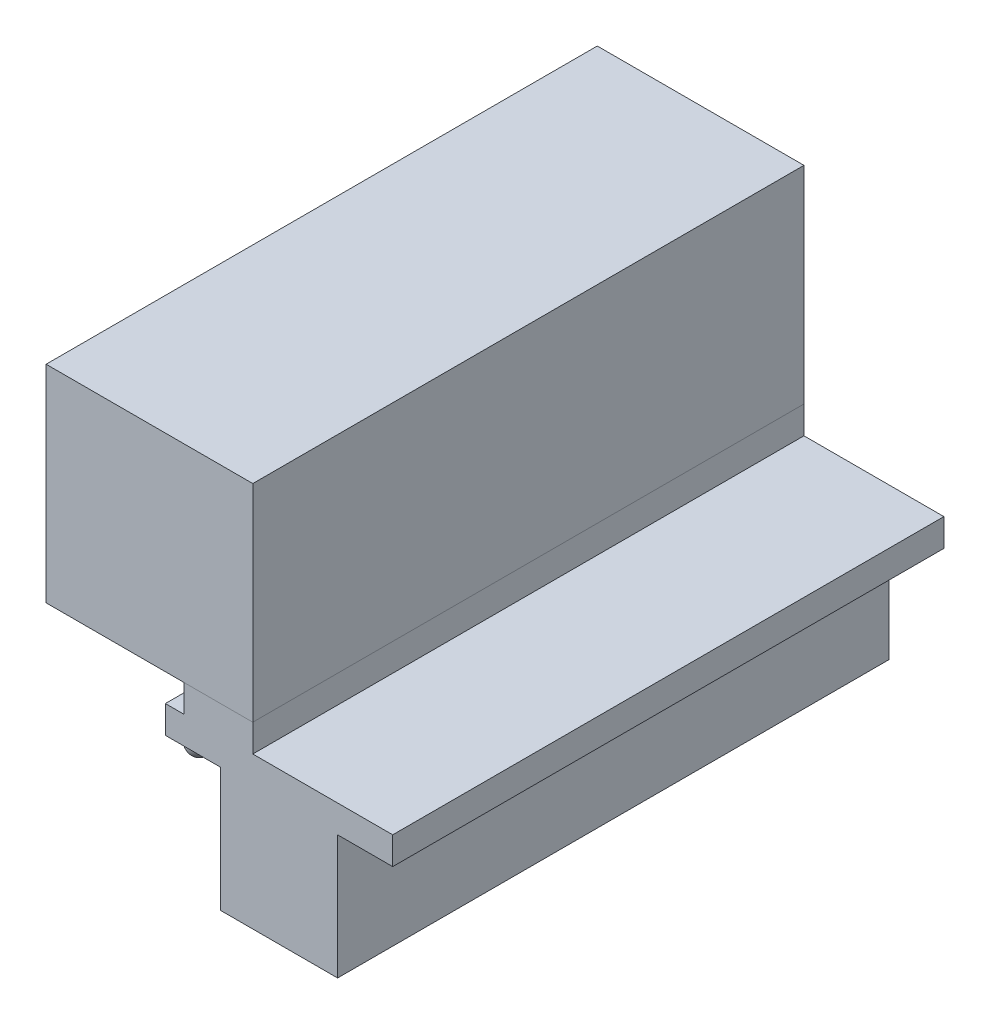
ISO-10303-21;
HEADER;
FILE_DESCRIPTION(('STEP AP214'),'2;1');
FILE_NAME('part.step','',(''),(''),'','','');
FILE_SCHEMA(('AUTOMOTIVE_DESIGN { 1 0 10303 214 1 1 1 1 }'));
ENDSEC;
DATA;
#1=APPLICATION_CONTEXT('core data for automotive mechanical design processes');
#2=APPLICATION_PROTOCOL_DEFINITION('international standard','automotive_design',2000,#1);
#3=PRODUCT_CONTEXT('',#1,'mechanical');
#4=PRODUCT('Part','Part','',(#3));
#5=PRODUCT_RELATED_PRODUCT_CATEGORY('part','',(#4));
#6=PRODUCT_DEFINITION_FORMATION('','',#4);
#7=PRODUCT_DEFINITION_CONTEXT('part definition',#1,'design');
#8=PRODUCT_DEFINITION('design','',#6,#7);
#9=PRODUCT_DEFINITION_SHAPE('','',#8);
#10=(LENGTH_UNIT() NAMED_UNIT(*) SI_UNIT(.MILLI.,.METRE.));
#11=(NAMED_UNIT(*) PLANE_ANGLE_UNIT() SI_UNIT($,.RADIAN.));
#12=(NAMED_UNIT(*) SI_UNIT($,.STERADIAN.) SOLID_ANGLE_UNIT());
#13=UNCERTAINTY_MEASURE_WITH_UNIT(LENGTH_MEASURE(1.E-05),#10,'distance_accuracy_value','');
#14=(GEOMETRIC_REPRESENTATION_CONTEXT(3) GLOBAL_UNCERTAINTY_ASSIGNED_CONTEXT((#13)) GLOBAL_UNIT_ASSIGNED_CONTEXT((#10,
#11,#12)) REPRESENTATION_CONTEXT('',''));
#15=CARTESIAN_POINT('',(0.,0.,0.));
#16=DIRECTION('',(0.,0.,1.));
#17=DIRECTION('',(1.,0.,0.));
#18=AXIS2_PLACEMENT_3D('',#15,#16,#17);
#19=CARTESIAN_POINT('',(4.69059892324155,51.,-40.));
#20=DIRECTION('',(-1.,0.,0.));
#21=DIRECTION('',(0.,0.,1.));
#22=AXIS2_PLACEMENT_3D('',#19,#20,#21);
#23=PLANE('',#22);
#24=DIRECTION('',(0.,0.,-1.));
#25=VECTOR('',#24,1.);
#26=CARTESIAN_POINT('',(4.69059892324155,21.,-40.));
#27=LINE('',#26,#25);
#28=CARTESIAN_POINT('',(4.69059892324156,21.,40.));
#29=VERTEX_POINT('',#28);
#30=CARTESIAN_POINT('',(4.69059892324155,21.,-40.));
#31=VERTEX_POINT('',#30);
#32=EDGE_CURVE('E398',#29,#31,#27,.T.);
#33=ORIENTED_EDGE('',*,*,#32,.T.);
#34=DIRECTION('',(0.,-1.,0.));
#35=VECTOR('',#34,1.);
#36=CARTESIAN_POINT('',(4.69059892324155,51.,-40.));
#37=LINE('',#36,#35);
#38=CARTESIAN_POINT('',(4.69059892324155,51.,-40.));
#39=VERTEX_POINT('',#38);
#40=EDGE_CURVE('E14',#39,#31,#37,.T.);
#41=ORIENTED_EDGE('',*,*,#40,.F.);
#42=DIRECTION('',(0.,0.,-1.));
#43=VECTOR('',#42,1.);
#44=CARTESIAN_POINT('',(4.69059892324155,51.,-40.));
#45=LINE('',#44,#43);
#46=CARTESIAN_POINT('',(4.69059892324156,51.,40.));
#47=VERTEX_POINT('',#46);
#48=EDGE_CURVE('E386',#47,#39,#45,.T.);
#49=ORIENTED_EDGE('',*,*,#48,.F.);
#50=DIRECTION('',(0.,-1.,0.));
#51=VECTOR('',#50,1.);
#52=CARTESIAN_POINT('',(4.69059892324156,51.,40.));
#53=LINE('',#52,#51);
#54=EDGE_CURVE('E394',#47,#29,#53,.T.);
#55=ORIENTED_EDGE('',*,*,#54,.T.);
#56=EDGE_LOOP('',(#33,#41,#49,#55));
#57=FACE_BOUND('',#56,.T.);
#58=ADVANCED_FACE('F335',(#57),#23,.F.);
#59=CARTESIAN_POINT('',(4.69059892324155,51.,-40.));
#60=DIRECTION('',(0.,0.,1.));
#61=DIRECTION('',(1.,0.,0.));
#62=AXIS2_PLACEMENT_3D('',#59,#60,#61);
#63=PLANE('',#62);
#64=DIRECTION('',(-1.,0.,0.));
#65=VECTOR('',#64,1.);
#66=CARTESIAN_POINT('',(4.69059892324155,21.,-40.));
#67=LINE('',#66,#65);
#68=CARTESIAN_POINT('',(-25.3094010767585,21.,-40.));
#69=VERTEX_POINT('',#68);
#70=EDGE_CURVE('E390',#31,#69,#67,.T.);
#71=ORIENTED_EDGE('',*,*,#70,.T.);
#72=DIRECTION('',(0.,-1.,0.));
#73=VECTOR('',#72,1.);
#74=CARTESIAN_POINT('',(-25.3094010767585,51.,-40.));
#75=LINE('',#74,#73);
#76=CARTESIAN_POINT('',(-25.3094010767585,51.,-40.));
#77=VERTEX_POINT('',#76);
#78=EDGE_CURVE('E343',#77,#69,#75,.T.);
#79=ORIENTED_EDGE('',*,*,#78,.F.);
#80=DIRECTION('',(-1.,0.,0.));
#81=VECTOR('',#80,1.);
#82=CARTESIAN_POINT('',(4.69059892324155,51.,-40.));
#83=LINE('',#82,#81);
#84=EDGE_CURVE('E381',#39,#77,#83,.T.);
#85=ORIENTED_EDGE('',*,*,#84,.F.);
#86=ORIENTED_EDGE('',*,*,#40,.T.);
#87=EDGE_LOOP('',(#71,#79,#85,#86));
#88=FACE_BOUND('',#87,.T.);
#89=ADVANCED_FACE('F389',(#88),#63,.F.);
#90=CARTESIAN_POINT('',(-25.3094010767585,51.,-40.));
#91=DIRECTION('',(1.,0.,0.));
#92=DIRECTION('',(0.,0.,-1.));
#93=AXIS2_PLACEMENT_3D('',#90,#91,#92);
#94=PLANE('',#93);
#95=DIRECTION('',(0.,0.,1.));
#96=VECTOR('',#95,1.);
#97=CARTESIAN_POINT('',(-25.3094010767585,21.,-40.));
#98=LINE('',#97,#96);
#99=CARTESIAN_POINT('',(-25.3094010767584,21.,40.));
#100=VERTEX_POINT('',#99);
#101=EDGE_CURVE('E368',#69,#100,#98,.T.);
#102=ORIENTED_EDGE('',*,*,#101,.T.);
#103=DIRECTION('',(0.,-1.,0.));
#104=VECTOR('',#103,1.);
#105=CARTESIAN_POINT('',(-25.3094010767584,51.,40.));
#106=LINE('',#105,#104);
#107=CARTESIAN_POINT('',(-25.3094010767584,51.,40.));
#108=VERTEX_POINT('',#107);
#109=EDGE_CURVE('E391',#108,#100,#106,.T.);
#110=ORIENTED_EDGE('',*,*,#109,.F.);
#111=DIRECTION('',(0.,0.,1.));
#112=VECTOR('',#111,1.);
#113=CARTESIAN_POINT('',(-25.3094010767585,51.,-40.));
#114=LINE('',#113,#112);
#115=EDGE_CURVE('E384',#77,#108,#114,.T.);
#116=ORIENTED_EDGE('',*,*,#115,.F.);
#117=ORIENTED_EDGE('',*,*,#78,.T.);
#118=EDGE_LOOP('',(#102,#110,#116,#117));
#119=FACE_BOUND('',#118,.T.);
#120=ADVANCED_FACE('F392',(#119),#94,.F.);
#121=CARTESIAN_POINT('',(4.69059892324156,51.,40.));
#122=DIRECTION('',(0.,0.,-1.));
#123=DIRECTION('',(-1.,0.,0.));
#124=AXIS2_PLACEMENT_3D('',#121,#122,#123);
#125=PLANE('',#124);
#126=DIRECTION('',(1.,0.,0.));
#127=VECTOR('',#126,1.);
#128=CARTESIAN_POINT('',(4.69059892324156,21.,40.));
#129=LINE('',#128,#127);
#130=EDGE_CURVE('E374',#100,#29,#129,.T.);
#131=ORIENTED_EDGE('',*,*,#130,.T.);
#132=ORIENTED_EDGE('',*,*,#54,.F.);
#133=DIRECTION('',(1.,0.,0.));
#134=VECTOR('',#133,1.);
#135=CARTESIAN_POINT('',(4.69059892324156,51.,40.));
#136=LINE('',#135,#134);
#137=EDGE_CURVE('E351',#108,#47,#136,.T.);
#138=ORIENTED_EDGE('',*,*,#137,.F.);
#139=ORIENTED_EDGE('',*,*,#109,.T.);
#140=EDGE_LOOP('',(#131,#132,#138,#139));
#141=FACE_BOUND('',#140,.T.);
#142=ADVANCED_FACE('F405',(#141),#125,.F.);
#143=CARTESIAN_POINT('',(4.69059892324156,51.,40.));
#144=DIRECTION('',(0.,-1.,0.));
#145=DIRECTION('',(0.,0.,-1.));
#146=AXIS2_PLACEMENT_3D('',#143,#144,#145);
#147=PLANE('',#146);
#148=ORIENTED_EDGE('',*,*,#48,.T.);
#149=ORIENTED_EDGE('',*,*,#84,.T.);
#150=ORIENTED_EDGE('',*,*,#115,.T.);
#151=ORIENTED_EDGE('',*,*,#137,.T.);
#152=EDGE_LOOP('',(#148,#149,#150,#151));
#153=FACE_BOUND('',#152,.T.);
#154=ADVANCED_FACE('F382',(#153),#147,.F.);
#155=CARTESIAN_POINT('',(4.69059892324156,21.,40.));
#156=DIRECTION('',(0.,-1.,0.));
#157=DIRECTION('',(0.,0.,-1.));
#158=AXIS2_PLACEMENT_3D('',#155,#156,#157);
#159=PLANE('',#158);
#160=ORIENTED_EDGE('',*,*,#32,.F.);
#161=ORIENTED_EDGE('',*,*,#130,.F.);
#162=ORIENTED_EDGE('',*,*,#101,.F.);
#163=ORIENTED_EDGE('',*,*,#70,.F.);
#164=EDGE_LOOP('',(#160,#161,#162,#163));
#165=FACE_BOUND('',#164,.T.);
#166=ADVANCED_FACE('F408',(#165),#159,.T.);
#167=CLOSED_SHELL('',(#58,#89,#120,#142,#154,#166));
#168=MANIFOLD_SOLID_BREP('B2',#167);
#169=CARTESIAN_POINT('',(4.69059892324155,21.,40.));
#170=DIRECTION('',(0.,-1.,0.));
#171=DIRECTION('',(0.,0.,-1.));
#172=AXIS2_PLACEMENT_3D('',#169,#170,#171);
#173=PLANE('',#172);
#174=DIRECTION('',(-1.,0.,0.));
#175=VECTOR('',#174,1.);
#176=CARTESIAN_POINT('',(4.69059892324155,21.,-40.));
#177=LINE('',#176,#175);
#178=CARTESIAN_POINT('',(4.69059892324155,21.,-40.));
#179=VERTEX_POINT('',#178);
#180=CARTESIAN_POINT('',(-5.30940107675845,21.,-40.));
#181=VERTEX_POINT('',#180);
#182=EDGE_CURVE('E1210',#179,#181,#177,.T.);
#183=ORIENTED_EDGE('',*,*,#182,.T.);
#184=DIRECTION('',(0.,0.,-1.));
#185=VECTOR('',#184,1.);
#186=CARTESIAN_POINT('',(-5.30940107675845,21.,40.));
#187=LINE('',#186,#185);
#188=CARTESIAN_POINT('',(-5.30940107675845,21.,40.));
#189=VERTEX_POINT('',#188);
#190=EDGE_CURVE('E1234',#189,#181,#187,.T.);
#191=ORIENTED_EDGE('',*,*,#190,.F.);
#192=DIRECTION('',(-1.,0.,0.));
#193=VECTOR('',#192,1.);
#194=CARTESIAN_POINT('',(4.69059892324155,21.,40.));
#195=LINE('',#194,#193);
#196=CARTESIAN_POINT('',(4.69059892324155,21.,40.));
#197=VERTEX_POINT('',#196);
#198=EDGE_CURVE('E1552',#197,#189,#195,.T.);
#199=ORIENTED_EDGE('',*,*,#198,.F.);
#200=DIRECTION('',(0.,0.,-1.));
#201=VECTOR('',#200,1.);
#202=CARTESIAN_POINT('',(4.69059892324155,21.,40.));
#203=LINE('',#202,#201);
#204=EDGE_CURVE('E1237',#197,#179,#203,.T.);
#205=ORIENTED_EDGE('',*,*,#204,.T.);
#206=EDGE_LOOP('',(#183,#191,#199,#205));
#207=FACE_BOUND('',#206,.T.);
#208=DIRECTION('',(0.,0.,-1.));
#209=VECTOR('',#208,1.);
#210=CARTESIAN_POINT('',(-3.08882394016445,21.,-35.));
#211=LINE('',#210,#209);
#212=CARTESIAN_POINT('',(-3.08882394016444,21.,35.));
#213=VERTEX_POINT('',#212);
#214=CARTESIAN_POINT('',(-3.08882394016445,21.,-35.));
#215=VERTEX_POINT('',#214);
#216=EDGE_CURVE('E643',#213,#215,#211,.T.);
#217=ORIENTED_EDGE('',*,*,#216,.T.);
#218=DIRECTION('',(1.,0.,0.));
#219=VECTOR('',#218,1.);
#220=CARTESIAN_POINT('',(-4.31730096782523,21.,-35.));
#221=LINE('',#220,#219);
#222=CARTESIAN_POINT('',(-2.68467875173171,21.,-35.));
#223=VERTEX_POINT('',#222);
#224=EDGE_CURVE('E630',#215,#223,#221,.T.);
#225=ORIENTED_EDGE('',*,*,#224,.T.);
#226=DIRECTION('',(0.,0.,1.));
#227=VECTOR('',#226,1.);
#228=CARTESIAN_POINT('',(-2.68467875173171,21.,-35.));
#229=LINE('',#228,#227);
#230=CARTESIAN_POINT('',(-2.6846787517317,21.,35.));
#231=VERTEX_POINT('',#230);
#232=EDGE_CURVE('E653',#223,#231,#229,.T.);
#233=ORIENTED_EDGE('',*,*,#232,.T.);
#234=DIRECTION('',(-1.,0.,0.));
#235=VECTOR('',#234,1.);
#236=CARTESIAN_POINT('',(-4.31730096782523,21.,35.));
#237=LINE('',#236,#235);
#238=EDGE_CURVE('E651',#231,#213,#237,.T.);
#239=ORIENTED_EDGE('',*,*,#238,.T.);
#240=EDGE_LOOP('',(#217,#225,#233,#239));
#241=FACE_BOUND('',#240,.T.);
#242=ADVANCED_FACE('F459',(#207,#241),#173,.F.);
#243=CARTESIAN_POINT('',(0.,13.,40.));
#244=DIRECTION('',(1.,0.,0.));
#245=DIRECTION('',(0.,1.,0.));
#246=AXIS2_PLACEMENT_3D('',#243,#244,#245);
#247=PLANE('',#246);
#248=DIRECTION('',(0.,1.,0.));
#249=VECTOR('',#248,1.);
#250=CARTESIAN_POINT('',(0.,13.,6.00000000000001));
#251=LINE('',#250,#249);
#252=CARTESIAN_POINT('',(0.,-5.,6.));
#253=VERTEX_POINT('',#252);
#254=CARTESIAN_POINT('',(0.,4.99999999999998,6.));
#255=VERTEX_POINT('',#254);
#256=EDGE_CURVE('E1533',#253,#255,#251,.T.);
#257=ORIENTED_EDGE('',*,*,#256,.F.);
#258=DIRECTION('',(0.,0.,-1.));
#259=VECTOR('',#258,1.);
#260=CARTESIAN_POINT('',(0.,-5.,40.));
#261=LINE('',#260,#259);
#262=CARTESIAN_POINT('',(0.,-5.,40.));
#263=VERTEX_POINT('',#262);
#264=EDGE_CURVE('E333',#263,#253,#261,.T.);
#265=ORIENTED_EDGE('',*,*,#264,.F.);
#266=DIRECTION('',(0.,-1.,0.));
#267=VECTOR('',#266,1.);
#268=CARTESIAN_POINT('',(0.,13.,40.));
#269=LINE('',#268,#267);
#270=CARTESIAN_POINT('',(0.,13.,40.));
#271=VERTEX_POINT('',#270);
#272=EDGE_CURVE('E1220',#271,#263,#269,.T.);
#273=ORIENTED_EDGE('',*,*,#272,.F.);
#274=DIRECTION('',(0.,0.,-1.));
#275=VECTOR('',#274,1.);
#276=CARTESIAN_POINT('',(0.,13.,40.));
#277=LINE('',#276,#275);
#278=CARTESIAN_POINT('',(0.,13.,-40.));
#279=VERTEX_POINT('',#278);
#280=EDGE_CURVE('E1221',#271,#279,#277,.T.);
#281=ORIENTED_EDGE('',*,*,#280,.T.);
#282=DIRECTION('',(0.,-1.,0.));
#283=VECTOR('',#282,1.);
#284=CARTESIAN_POINT('',(0.,13.,-40.));
#285=LINE('',#284,#283);
#286=CARTESIAN_POINT('',(0.,-5.,-40.));
#287=VERTEX_POINT('',#286);
#288=EDGE_CURVE('E1190',#279,#287,#285,.T.);
#289=ORIENTED_EDGE('',*,*,#288,.T.);
#290=CARTESIAN_POINT('',(0.,-5.,-6.00000000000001));
#291=VERTEX_POINT('',#290);
#292=EDGE_CURVE('E471',#291,#287,#261,.T.);
#293=ORIENTED_EDGE('',*,*,#292,.F.);
#294=DIRECTION('',(0.,-1.,0.));
#295=VECTOR('',#294,1.);
#296=CARTESIAN_POINT('',(0.,13.,-5.99999999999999));
#297=LINE('',#296,#295);
#298=CARTESIAN_POINT('',(0.,4.99999999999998,-6.));
#299=VERTEX_POINT('',#298);
#300=EDGE_CURVE('E1529',#299,#291,#297,.T.);
#301=ORIENTED_EDGE('',*,*,#300,.F.);
#302=DIRECTION('',(0.,0.,1.));
#303=VECTOR('',#302,1.);
#304=CARTESIAN_POINT('',(0.,4.99999999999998,-6.));
#305=LINE('',#304,#303);
#306=EDGE_CURVE('E1521',#299,#255,#305,.T.);
#307=ORIENTED_EDGE('',*,*,#306,.T.);
#308=EDGE_LOOP('',(#257,#265,#273,#281,#289,#293,#301,#307));
#309=FACE_BOUND('',#308,.T.);
#310=ADVANCED_FACE('F461',(#309),#247,.F.);
#311=CARTESIAN_POINT('',(0.,-5.,40.));
#312=DIRECTION('',(0.,1.,0.));
#313=DIRECTION('',(0.,0.,1.));
#314=AXIS2_PLACEMENT_3D('',#311,#312,#313);
#315=PLANE('',#314);
#316=DIRECTION('',(1.,0.,0.));
#317=VECTOR('',#316,1.);
#318=CARTESIAN_POINT('',(0.,-5.,-40.));
#319=LINE('',#318,#317);
#320=CARTESIAN_POINT('',(17.,-5.,-40.));
#321=VERTEX_POINT('',#320);
#322=EDGE_CURVE('E1180',#287,#321,#319,.T.);
#323=ORIENTED_EDGE('',*,*,#322,.T.);
#324=DIRECTION('',(0.,0.,-1.));
#325=VECTOR('',#324,1.);
#326=CARTESIAN_POINT('',(17.,-5.,40.));
#327=LINE('',#326,#325);
#328=CARTESIAN_POINT('',(17.,-5.,40.));
#329=VERTEX_POINT('',#328);
#330=EDGE_CURVE('E1182',#329,#321,#327,.T.);
#331=ORIENTED_EDGE('',*,*,#330,.F.);
#332=DIRECTION('',(1.,0.,0.));
#333=VECTOR('',#332,1.);
#334=CARTESIAN_POINT('',(0.,-5.,40.));
#335=LINE('',#334,#333);
#336=EDGE_CURVE('E1541',#263,#329,#335,.T.);
#337=ORIENTED_EDGE('',*,*,#336,.F.);
#338=ORIENTED_EDGE('',*,*,#264,.T.);
#339=EDGE_CURVE('E469',#253,#291,#261,.T.);
#340=ORIENTED_EDGE('',*,*,#339,.T.);
#341=ORIENTED_EDGE('',*,*,#292,.T.);
#342=EDGE_LOOP('',(#323,#331,#337,#338,#340,#341));
#343=FACE_BOUND('',#342,.T.);
#344=ADVANCED_FACE('F1170',(#343),#315,.F.);
#345=CARTESIAN_POINT('',(17.,-5.,40.));
#346=DIRECTION('',(-1.,0.,0.));
#347=DIRECTION('',(0.,-1.,0.));
#348=AXIS2_PLACEMENT_3D('',#345,#346,#347);
#349=PLANE('',#348);
#350=DIRECTION('',(0.,1.,0.));
#351=VECTOR('',#350,1.);
#352=CARTESIAN_POINT('',(17.,-5.,-40.));
#353=LINE('',#352,#351);
#354=CARTESIAN_POINT('',(17.,13.,-40.));
#355=VERTEX_POINT('',#354);
#356=EDGE_CURVE('E1189',#321,#355,#353,.T.);
#357=ORIENTED_EDGE('',*,*,#356,.T.);
#358=DIRECTION('',(0.,0.,-1.));
#359=VECTOR('',#358,1.);
#360=CARTESIAN_POINT('',(17.,13.,40.));
#361=LINE('',#360,#359);
#362=CARTESIAN_POINT('',(17.,13.,40.));
#363=VERTEX_POINT('',#362);
#364=EDGE_CURVE('E1195',#363,#355,#361,.T.);
#365=ORIENTED_EDGE('',*,*,#364,.F.);
#366=DIRECTION('',(0.,1.,0.));
#367=VECTOR('',#366,1.);
#368=CARTESIAN_POINT('',(17.,-5.,40.));
#369=LINE('',#368,#367);
#370=EDGE_CURVE('E1194',#329,#363,#369,.T.);
#371=ORIENTED_EDGE('',*,*,#370,.F.);
#372=ORIENTED_EDGE('',*,*,#330,.T.);
#373=EDGE_LOOP('',(#357,#365,#371,#372));
#374=FACE_BOUND('',#373,.T.);
#375=ADVANCED_FACE('F1167',(#374),#349,.F.);
#376=CARTESIAN_POINT('',(17.,13.,40.));
#377=DIRECTION('',(0.,1.,0.));
#378=DIRECTION('',(0.,0.,1.));
#379=AXIS2_PLACEMENT_3D('',#376,#377,#378);
#380=PLANE('',#379);
#381=DIRECTION('',(1.,0.,0.));
#382=VECTOR('',#381,1.);
#383=CARTESIAN_POINT('',(17.,13.,-40.));
#384=LINE('',#383,#382);
#385=CARTESIAN_POINT('',(25.,13.,-40.));
#386=VERTEX_POINT('',#385);
#387=EDGE_CURVE('E1199',#355,#386,#384,.T.);
#388=ORIENTED_EDGE('',*,*,#387,.T.);
#389=DIRECTION('',(0.,0.,-1.));
#390=VECTOR('',#389,1.);
#391=CARTESIAN_POINT('',(25.,13.,40.));
#392=LINE('',#391,#390);
#393=CARTESIAN_POINT('',(25.,13.,40.));
#394=VERTEX_POINT('',#393);
#395=EDGE_CURVE('E1246',#394,#386,#392,.T.);
#396=ORIENTED_EDGE('',*,*,#395,.F.);
#397=DIRECTION('',(1.,0.,0.));
#398=VECTOR('',#397,1.);
#399=CARTESIAN_POINT('',(17.,13.,40.));
#400=LINE('',#399,#398);
#401=EDGE_CURVE('E1544',#363,#394,#400,.T.);
#402=ORIENTED_EDGE('',*,*,#401,.F.);
#403=ORIENTED_EDGE('',*,*,#364,.T.);
#404=EDGE_LOOP('',(#388,#396,#402,#403));
#405=FACE_BOUND('',#404,.T.);
#406=ADVANCED_FACE('F1163',(#405),#380,.F.);
#407=CARTESIAN_POINT('',(25.,13.,40.));
#408=DIRECTION('',(-1.,0.,0.));
#409=DIRECTION('',(0.,0.,1.));
#410=AXIS2_PLACEMENT_3D('',#407,#408,#409);
#411=PLANE('',#410);
#412=DIRECTION('',(0.,1.,0.));
#413=VECTOR('',#412,1.);
#414=CARTESIAN_POINT('',(25.,13.,-40.));
#415=LINE('',#414,#413);
#416=CARTESIAN_POINT('',(25.,17.,-40.));
#417=VERTEX_POINT('',#416);
#418=EDGE_CURVE('E1201',#386,#417,#415,.T.);
#419=ORIENTED_EDGE('',*,*,#418,.T.);
#420=DIRECTION('',(0.,0.,-1.));
#421=VECTOR('',#420,1.);
#422=CARTESIAN_POINT('',(25.,17.,40.));
#423=LINE('',#422,#421);
#424=CARTESIAN_POINT('',(25.,17.,40.));
#425=VERTEX_POINT('',#424);
#426=EDGE_CURVE('E1243',#425,#417,#423,.T.);
#427=ORIENTED_EDGE('',*,*,#426,.F.);
#428=DIRECTION('',(0.,1.,0.));
#429=VECTOR('',#428,1.);
#430=CARTESIAN_POINT('',(25.,13.,40.));
#431=LINE('',#430,#429);
#432=EDGE_CURVE('E1546',#394,#425,#431,.T.);
#433=ORIENTED_EDGE('',*,*,#432,.F.);
#434=ORIENTED_EDGE('',*,*,#395,.T.);
#435=EDGE_LOOP('',(#419,#427,#433,#434));
#436=FACE_BOUND('',#435,.T.);
#437=ADVANCED_FACE('F1159',(#436),#411,.F.);
#438=CARTESIAN_POINT('',(25.,17.,40.));
#439=DIRECTION('',(0.,-1.,0.));
#440=DIRECTION('',(0.,0.,-1.));
#441=AXIS2_PLACEMENT_3D('',#438,#439,#440);
#442=PLANE('',#441);
#443=DIRECTION('',(-1.,0.,0.));
#444=VECTOR('',#443,1.);
#445=CARTESIAN_POINT('',(25.,17.,-40.));
#446=LINE('',#445,#444);
#447=CARTESIAN_POINT('',(4.69059892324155,17.,-40.));
#448=VERTEX_POINT('',#447);
#449=EDGE_CURVE('E1206',#417,#448,#446,.T.);
#450=ORIENTED_EDGE('',*,*,#449,.T.);
#451=DIRECTION('',(0.,0.,-1.));
#452=VECTOR('',#451,1.);
#453=CARTESIAN_POINT('',(4.69059892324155,17.,40.));
#454=LINE('',#453,#452);
#455=CARTESIAN_POINT('',(4.69059892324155,17.,40.));
#456=VERTEX_POINT('',#455);
#457=EDGE_CURVE('E1240',#456,#448,#454,.T.);
#458=ORIENTED_EDGE('',*,*,#457,.F.);
#459=DIRECTION('',(-1.,0.,0.));
#460=VECTOR('',#459,1.);
#461=CARTESIAN_POINT('',(25.,17.,40.));
#462=LINE('',#461,#460);
#463=EDGE_CURVE('E1548',#425,#456,#462,.T.);
#464=ORIENTED_EDGE('',*,*,#463,.F.);
#465=ORIENTED_EDGE('',*,*,#426,.T.);
#466=EDGE_LOOP('',(#450,#458,#464,#465));
#467=FACE_BOUND('',#466,.T.);
#468=ADVANCED_FACE('F1155',(#467),#442,.F.);
#469=CARTESIAN_POINT('',(4.69059892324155,17.,40.));
#470=DIRECTION('',(-1.,0.,0.));
#471=DIRECTION('',(0.,0.,1.));
#472=AXIS2_PLACEMENT_3D('',#469,#470,#471);
#473=PLANE('',#472);
#474=DIRECTION('',(0.,1.,0.));
#475=VECTOR('',#474,1.);
#476=CARTESIAN_POINT('',(4.69059892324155,17.,-40.));
#477=LINE('',#476,#475);
#478=EDGE_CURVE('E1208',#448,#179,#477,.T.);
#479=ORIENTED_EDGE('',*,*,#478,.T.);
#480=ORIENTED_EDGE('',*,*,#204,.F.);
#481=DIRECTION('',(0.,1.,0.));
#482=VECTOR('',#481,1.);
#483=CARTESIAN_POINT('',(4.69059892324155,17.,40.));
#484=LINE('',#483,#482);
#485=EDGE_CURVE('E1550',#456,#197,#484,.T.);
#486=ORIENTED_EDGE('',*,*,#485,.F.);
#487=ORIENTED_EDGE('',*,*,#457,.T.);
#488=EDGE_LOOP('',(#479,#480,#486,#487));
#489=FACE_BOUND('',#488,.T.);
#490=ADVANCED_FACE('F1148',(#489),#473,.F.);
#491=CARTESIAN_POINT('',(-5.30940107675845,21.,40.));
#492=DIRECTION('',(1.,0.,0.));
#493=DIRECTION('',(0.,1.,0.));
#494=AXIS2_PLACEMENT_3D('',#491,#492,#493);
#495=PLANE('',#494);
#496=DIRECTION('',(0.,-1.,0.));
#497=VECTOR('',#496,1.);
#498=CARTESIAN_POINT('',(-5.30940107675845,21.,-40.));
#499=LINE('',#498,#497);
#500=CARTESIAN_POINT('',(-5.30940107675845,17.,-40.));
#501=VERTEX_POINT('',#500);
#502=EDGE_CURVE('E1212',#181,#501,#499,.T.);
#503=ORIENTED_EDGE('',*,*,#502,.T.);
#504=DIRECTION('',(0.,0.,-1.));
#505=VECTOR('',#504,1.);
#506=CARTESIAN_POINT('',(-5.30940107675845,17.,40.));
#507=LINE('',#506,#505);
#508=CARTESIAN_POINT('',(-5.30940107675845,17.,40.));
#509=VERTEX_POINT('',#508);
#510=EDGE_CURVE('E1231',#509,#501,#507,.T.);
#511=ORIENTED_EDGE('',*,*,#510,.F.);
#512=DIRECTION('',(0.,-1.,0.));
#513=VECTOR('',#512,1.);
#514=CARTESIAN_POINT('',(-5.30940107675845,21.,40.));
#515=LINE('',#514,#513);
#516=EDGE_CURVE('E1554',#189,#509,#515,.T.);
#517=ORIENTED_EDGE('',*,*,#516,.F.);
#518=ORIENTED_EDGE('',*,*,#190,.T.);
#519=EDGE_LOOP('',(#503,#511,#517,#518));
#520=FACE_BOUND('',#519,.T.);
#521=ADVANCED_FACE('F1144',(#520),#495,.F.);
#522=CARTESIAN_POINT('',(-5.30940107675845,17.,40.));
#523=DIRECTION('',(0.,-1.,0.));
#524=DIRECTION('',(0.,0.,-1.));
#525=AXIS2_PLACEMENT_3D('',#522,#523,#524);
#526=PLANE('',#525);
#527=DIRECTION('',(-1.,0.,0.));
#528=VECTOR('',#527,1.);
#529=CARTESIAN_POINT('',(-5.30940107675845,17.,-40.));
#530=LINE('',#529,#528);
#531=CARTESIAN_POINT('',(-8.,17.,-40.));
#532=VERTEX_POINT('',#531);
#533=EDGE_CURVE('E1214',#501,#532,#530,.T.);
#534=ORIENTED_EDGE('',*,*,#533,.T.);
#535=DIRECTION('',(0.,0.,-1.));
#536=VECTOR('',#535,1.);
#537=CARTESIAN_POINT('',(-8.,17.,40.));
#538=LINE('',#537,#536);
#539=CARTESIAN_POINT('',(-8.,17.,40.));
#540=VERTEX_POINT('',#539);
#541=EDGE_CURVE('E1228',#540,#532,#538,.T.);
#542=ORIENTED_EDGE('',*,*,#541,.F.);
#543=DIRECTION('',(-1.,0.,0.));
#544=VECTOR('',#543,1.);
#545=CARTESIAN_POINT('',(-5.30940107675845,17.,40.));
#546=LINE('',#545,#544);
#547=EDGE_CURVE('E1556',#509,#540,#546,.T.);
#548=ORIENTED_EDGE('',*,*,#547,.F.);
#549=ORIENTED_EDGE('',*,*,#510,.T.);
#550=EDGE_LOOP('',(#534,#542,#548,#549));
#551=FACE_BOUND('',#550,.T.);
#552=ADVANCED_FACE('F1140',(#551),#526,.F.);
#553=CARTESIAN_POINT('',(-8.,17.,40.));
#554=DIRECTION('',(1.,0.,0.));
#555=DIRECTION('',(0.,0.,-1.));
#556=AXIS2_PLACEMENT_3D('',#553,#554,#555);
#557=PLANE('',#556);
#558=DIRECTION('',(0.,-1.,0.));
#559=VECTOR('',#558,1.);
#560=CARTESIAN_POINT('',(-8.,17.,-40.));
#561=LINE('',#560,#559);
#562=CARTESIAN_POINT('',(-8.,13.,-40.));
#563=VERTEX_POINT('',#562);
#564=EDGE_CURVE('E1216',#532,#563,#561,.T.);
#565=ORIENTED_EDGE('',*,*,#564,.T.);
#566=DIRECTION('',(0.,0.,-1.));
#567=VECTOR('',#566,1.);
#568=CARTESIAN_POINT('',(-8.,13.,40.));
#569=LINE('',#568,#567);
#570=CARTESIAN_POINT('',(-8.,13.,40.));
#571=VERTEX_POINT('',#570);
#572=EDGE_CURVE('E1224',#571,#563,#569,.T.);
#573=ORIENTED_EDGE('',*,*,#572,.F.);
#574=DIRECTION('',(0.,-1.,0.));
#575=VECTOR('',#574,1.);
#576=CARTESIAN_POINT('',(-8.,17.,40.));
#577=LINE('',#576,#575);
#578=EDGE_CURVE('E1558',#540,#571,#577,.T.);
#579=ORIENTED_EDGE('',*,*,#578,.F.);
#580=ORIENTED_EDGE('',*,*,#541,.T.);
#581=EDGE_LOOP('',(#565,#573,#579,#580));
#582=FACE_BOUND('',#581,.T.);
#583=ADVANCED_FACE('F1136',(#582),#557,.F.);
#584=CARTESIAN_POINT('',(-8.,13.,40.));
#585=DIRECTION('',(0.,1.,0.));
#586=DIRECTION('',(0.,0.,1.));
#587=AXIS2_PLACEMENT_3D('',#584,#585,#586);
#588=PLANE('',#587);
#589=DIRECTION('',(1.,0.,0.));
#590=VECTOR('',#589,1.);
#591=CARTESIAN_POINT('',(-8.,13.,-40.));
#592=LINE('',#591,#590);
#593=EDGE_CURVE('E1218',#563,#279,#592,.T.);
#594=ORIENTED_EDGE('',*,*,#593,.T.);
#595=ORIENTED_EDGE('',*,*,#280,.F.);
#596=DIRECTION('',(1.,0.,0.));
#597=VECTOR('',#596,1.);
#598=CARTESIAN_POINT('',(-8.,13.,40.));
#599=LINE('',#598,#597);
#600=EDGE_CURVE('E1225',#571,#271,#599,.T.);
#601=ORIENTED_EDGE('',*,*,#600,.F.);
#602=ORIENTED_EDGE('',*,*,#572,.T.);
#603=EDGE_LOOP('',(#594,#595,#601,#602));
#604=FACE_BOUND('',#603,.T.);
#605=ADVANCED_FACE('F1129',(#604),#588,.F.);
#606=CARTESIAN_POINT('',(0.,-5.,40.));
#607=DIRECTION('',(0.,0.,1.));
#608=DIRECTION('',(1.,0.,0.));
#609=AXIS2_PLACEMENT_3D('',#606,#607,#608);
#610=PLANE('',#609);
#611=ORIENTED_EDGE('',*,*,#272,.T.);
#612=ORIENTED_EDGE('',*,*,#336,.T.);
#613=ORIENTED_EDGE('',*,*,#370,.T.);
#614=ORIENTED_EDGE('',*,*,#401,.T.);
#615=ORIENTED_EDGE('',*,*,#432,.T.);
#616=ORIENTED_EDGE('',*,*,#463,.T.);
#617=ORIENTED_EDGE('',*,*,#485,.T.);
#618=ORIENTED_EDGE('',*,*,#198,.T.);
#619=ORIENTED_EDGE('',*,*,#516,.T.);
#620=ORIENTED_EDGE('',*,*,#547,.T.);
#621=ORIENTED_EDGE('',*,*,#578,.T.);
#622=ORIENTED_EDGE('',*,*,#600,.T.);
#623=EDGE_LOOP('',(#611,#612,#613,#614,#615,#616,#617,#618,#619,#620,#621,#622));
#624=FACE_BOUND('',#623,.T.);
#625=ADVANCED_FACE('F1126',(#624),#610,.T.);
#626=CARTESIAN_POINT('',(0.,-5.,-40.));
#627=DIRECTION('',(0.,0.,1.));
#628=DIRECTION('',(1.,0.,0.));
#629=AXIS2_PLACEMENT_3D('',#626,#627,#628);
#630=PLANE('',#629);
#631=ORIENTED_EDGE('',*,*,#288,.F.);
#632=ORIENTED_EDGE('',*,*,#593,.F.);
#633=ORIENTED_EDGE('',*,*,#564,.F.);
#634=ORIENTED_EDGE('',*,*,#533,.F.);
#635=ORIENTED_EDGE('',*,*,#502,.F.);
#636=ORIENTED_EDGE('',*,*,#182,.F.);
#637=ORIENTED_EDGE('',*,*,#478,.F.);
#638=ORIENTED_EDGE('',*,*,#449,.F.);
#639=ORIENTED_EDGE('',*,*,#418,.F.);
#640=ORIENTED_EDGE('',*,*,#387,.F.);
#641=ORIENTED_EDGE('',*,*,#356,.F.);
#642=ORIENTED_EDGE('',*,*,#322,.F.);
#643=EDGE_LOOP('',(#631,#632,#633,#634,#635,#636,#637,#638,#639,#640,#641,#642));
#644=FACE_BOUND('',#643,.T.);
#645=ADVANCED_FACE('F1124',(#644),#630,.F.);
#646=CARTESIAN_POINT('',(11.6422635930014,11.7216640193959,6.));
#647=DIRECTION('',(0.,0.,-1.));
#648=DIRECTION('',(0.,1.,0.));
#649=AXIS2_PLACEMENT_3D('',#646,#647,#648);
#650=PLANE('',#649);
#651=DIRECTION('',(0.86602540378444,0.499999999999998,0.));
#652=VECTOR('',#651,1.);
#653=CARTESIAN_POINT('',(-2.25166604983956,-6.29999999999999,6.));
#654=LINE('',#653,#652);
#655=CARTESIAN_POINT('',(-2.25166604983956,-6.29999999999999,6.));
#656=VERTEX_POINT('',#655);
#657=EDGE_CURVE('E1518',#656,#253,#654,.T.);
#658=ORIENTED_EDGE('',*,*,#657,.T.);
#659=ORIENTED_EDGE('',*,*,#256,.T.);
#660=DIRECTION('',(-0.86602540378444,-0.499999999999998,0.));
#661=VECTOR('',#660,1.);
#662=CARTESIAN_POINT('',(11.6422635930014,11.7216640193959,6.));
#663=LINE('',#662,#661);
#664=CARTESIAN_POINT('',(-6.58179306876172,1.2,6.));
#665=VERTEX_POINT('',#664);
#666=EDGE_CURVE('E1526',#255,#665,#663,.T.);
#667=ORIENTED_EDGE('',*,*,#666,.T.);
#668=DIRECTION('',(0.499999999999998,-0.86602540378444,0.));
#669=VECTOR('',#668,1.);
#670=CARTESIAN_POINT('',(-6.58179306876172,1.2,6.));
#671=LINE('',#670,#669);
#672=EDGE_CURVE('E1509',#665,#656,#671,.T.);
#673=ORIENTED_EDGE('',*,*,#672,.T.);
#674=EDGE_LOOP('',(#658,#659,#667,#673));
#675=FACE_BOUND('',#674,.T.);
#676=ADVANCED_FACE('F1117',(#675),#650,.F.);
#677=CARTESIAN_POINT('',(11.6422635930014,11.7216640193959,-6.));
#678=DIRECTION('',(0.,0.,1.));
#679=DIRECTION('',(0.,-1.,0.));
#680=AXIS2_PLACEMENT_3D('',#677,#678,#679);
#681=PLANE('',#680);
#682=DIRECTION('',(-0.86602540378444,-0.499999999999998,0.));
#683=VECTOR('',#682,1.);
#684=CARTESIAN_POINT('',(11.6422635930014,11.7216640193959,-6.));
#685=LINE('',#684,#683);
#686=CARTESIAN_POINT('',(-6.58179306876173,1.20000000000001,-6.));
#687=VERTEX_POINT('',#686);
#688=EDGE_CURVE('E1527',#299,#687,#685,.T.);
#689=ORIENTED_EDGE('',*,*,#688,.F.);
#690=ORIENTED_EDGE('',*,*,#300,.T.);
#691=DIRECTION('',(0.86602540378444,0.499999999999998,0.));
#692=VECTOR('',#691,1.);
#693=CARTESIAN_POINT('',(-2.25166604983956,-6.29999999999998,-6.));
#694=LINE('',#693,#692);
#695=CARTESIAN_POINT('',(-2.25166604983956,-6.29999999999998,-6.));
#696=VERTEX_POINT('',#695);
#697=EDGE_CURVE('E1519',#696,#291,#694,.T.);
#698=ORIENTED_EDGE('',*,*,#697,.F.);
#699=DIRECTION('',(-0.499999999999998,0.86602540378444,0.));
#700=VECTOR('',#699,1.);
#701=CARTESIAN_POINT('',(-6.58179306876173,1.20000000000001,-6.));
#702=LINE('',#701,#700);
#703=EDGE_CURVE('E1502',#696,#687,#702,.T.);
#704=ORIENTED_EDGE('',*,*,#703,.T.);
#705=EDGE_LOOP('',(#689,#690,#698,#704));
#706=FACE_BOUND('',#705,.T.);
#707=ADVANCED_FACE('F1113',(#706),#681,.F.);
#708=CARTESIAN_POINT('',(-2.25166604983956,-6.29999999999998,-6.));
#709=DIRECTION('',(0.499999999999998,-0.86602540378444,0.));
#710=DIRECTION('',(0.86602540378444,0.499999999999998,0.));
#711=AXIS2_PLACEMENT_3D('',#708,#709,#710);
#712=PLANE('',#711);
#713=ORIENTED_EDGE('',*,*,#339,.F.);
#714=ORIENTED_EDGE('',*,*,#657,.F.);
#715=DIRECTION('',(0.,0.,-1.));
#716=VECTOR('',#715,1.);
#717=CARTESIAN_POINT('',(-2.25166604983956,-6.29999999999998,-6.));
#718=LINE('',#717,#716);
#719=EDGE_CURVE('E1515',#656,#696,#718,.T.);
#720=ORIENTED_EDGE('',*,*,#719,.T.);
#721=ORIENTED_EDGE('',*,*,#697,.T.);
#722=EDGE_LOOP('',(#713,#714,#720,#721));
#723=FACE_BOUND('',#722,.T.);
#724=ADVANCED_FACE('F1110',(#723),#712,.T.);
#725=CARTESIAN_POINT('',(11.6422635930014,11.7216640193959,-6.));
#726=DIRECTION('',(0.499999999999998,-0.86602540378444,0.));
#727=DIRECTION('',(0.86602540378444,0.499999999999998,0.));
#728=AXIS2_PLACEMENT_3D('',#725,#726,#727);
#729=PLANE('',#728);
#730=ORIENTED_EDGE('',*,*,#306,.F.);
#731=ORIENTED_EDGE('',*,*,#688,.T.);
#732=DIRECTION('',(0.,0.,1.));
#733=VECTOR('',#732,1.);
#734=CARTESIAN_POINT('',(-6.58179306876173,1.20000000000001,-6.));
#735=LINE('',#734,#733);
#736=EDGE_CURVE('E1504',#687,#665,#735,.T.);
#737=ORIENTED_EDGE('',*,*,#736,.T.);
#738=ORIENTED_EDGE('',*,*,#666,.F.);
#739=EDGE_LOOP('',(#730,#731,#737,#738));
#740=FACE_BOUND('',#739,.T.);
#741=ADVANCED_FACE('F1108',(#740),#729,.F.);
#742=CARTESIAN_POINT('',(-2.25166604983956,-6.29999999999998,-6.));
#743=DIRECTION('',(-0.86602540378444,-0.499999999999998,0.));
#744=DIRECTION('',(0.499999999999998,-0.86602540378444,0.));
#745=AXIS2_PLACEMENT_3D('',#742,#743,#744);
#746=PLANE('',#745);
#747=CARTESIAN_POINT('',(-4.41672955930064,-2.54999999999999,0.));
#748=DIRECTION('',(-0.86602540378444,-0.499999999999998,0.));
#749=DIRECTION('',(0.499999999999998,-0.86602540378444,0.));
#750=AXIS2_PLACEMENT_3D('',#747,#748,#749);
#751=CIRCLE('',#750,2.);
#752=CARTESIAN_POINT('',(-3.41672955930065,-4.28205080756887,0.));
#753=VERTEX_POINT('',#752);
#754=EDGE_CURVE('E1596',#753,#753,#751,.F.);
#755=ORIENTED_EDGE('',*,*,#754,.T.);
#756=EDGE_LOOP('',(#755));
#757=FACE_BOUND('',#756,.T.);
#758=ORIENTED_EDGE('',*,*,#703,.F.);
#759=ORIENTED_EDGE('',*,*,#719,.F.);
#760=ORIENTED_EDGE('',*,*,#672,.F.);
#761=ORIENTED_EDGE('',*,*,#736,.F.);
#762=EDGE_LOOP('',(#758,#759,#760,#761));
#763=FACE_BOUND('',#762,.T.);
#764=ADVANCED_FACE('F1091',(#757,#763),#746,.T.);
#765=CARTESIAN_POINT('',(0.649999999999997,-1.12583302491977,0.));
#766=CARTESIAN_POINT('',(4.1681050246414,0.905345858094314,0.));
#767=CARTESIAN_POINT('',(7.14142514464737,4.68820250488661,0.));
#768=CARTESIAN_POINT('',(8.31755707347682,8.22843114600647,0.));
#769=CARTESIAN_POINT('',(0.649999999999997,-1.12583302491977,-0.0358744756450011));
#770=CARTESIAN_POINT('',(4.1681050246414,0.905345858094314,-0.0358744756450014));
#771=CARTESIAN_POINT('',(7.14142514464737,4.68820250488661,-0.12832023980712));
#772=CARTESIAN_POINT('',(8.31755707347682,8.22843114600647,-0.220766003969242));
#773=CARTESIAN_POINT('',(0.648543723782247,-1.12331068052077,-0.106948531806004));
#774=CARTESIAN_POINT('',(4.16860530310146,0.908997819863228,-0.106948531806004));
#775=CARTESIAN_POINT('',(7.14077166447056,4.69032868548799,-0.382546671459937));
#776=CARTESIAN_POINT('',(8.31574983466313,8.22903154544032,-0.658144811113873));
#777=CARTESIAN_POINT('',(0.64215830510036,-1.11225081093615,-0.211199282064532));
#778=CARTESIAN_POINT('',(4.17061976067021,0.924907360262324,-0.211199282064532));
#779=CARTESIAN_POINT('',(7.13781674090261,4.69959975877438,-0.755443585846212));
#780=CARTESIAN_POINT('',(8.30782552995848,8.23166415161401,-1.29968788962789));
#781=CARTESIAN_POINT('',(0.631739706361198,-1.09420526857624,-0.31275404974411));
#782=CARTESIAN_POINT('',(4.17353245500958,0.95064972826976,-0.31275404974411));
#783=CARTESIAN_POINT('',(7.1328083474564,4.71461865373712,-1.11869717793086));
#784=CARTESIAN_POINT('',(8.29489604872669,8.23595957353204,-1.9246403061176));
#785=CARTESIAN_POINT('',(0.546035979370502,-0.945762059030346,-0.90389286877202));
#786=CARTESIAN_POINT('',(4.19430390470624,1.16056640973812,-0.903892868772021));
#787=CARTESIAN_POINT('',(7.09001490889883,4.8372441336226,-3.23315526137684));
#788=CARTESIAN_POINT('',(8.18853772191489,8.27129385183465,-5.56241765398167));
#789=CARTESIAN_POINT('',(0.286995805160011,-0.49709131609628,-1.3));
#790=CARTESIAN_POINT('',(4.20184636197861,1.76314870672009,-1.3));
#791=CARTESIAN_POINT('',(6.9330517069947,5.19193434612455,-4.65));
#792=CARTESIAN_POINT('',(7.86706886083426,8.37809197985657,-8.));
#793=CARTESIAN_POINT('',(-0.358744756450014,0.621364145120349,-1.3));
#794=CARTESIAN_POINT('',(3.36261869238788,2.76989433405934,-1.3));
#795=CARTESIAN_POINT('',(6.11275584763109,5.82842142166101,-4.65));
#796=CARTESIAN_POINT('',(7.06570481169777,8.64432050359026,-8.));
#797=CARTESIAN_POINT('',(-0.649999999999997,1.12583302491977,-0.71748951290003));
#798=CARTESIAN_POINT('',(2.43747128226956,2.90838540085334,-0.717489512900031));
#799=CARTESIAN_POINT('',(5.46945826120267,5.9577068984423,-2.56640479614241));
#800=CARTESIAN_POINT('',(6.70425704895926,8.76440039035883,-4.4153200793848));
#801=CARTESIAN_POINT('',(-0.649999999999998,1.12583302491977,0.71748951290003));
#802=CARTESIAN_POINT('',(2.43747128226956,2.90838540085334,0.717489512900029));
#803=CARTESIAN_POINT('',(5.46945826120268,5.9577068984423,2.56640479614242));
#804=CARTESIAN_POINT('',(6.70425704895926,8.76440039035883,4.4153200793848));
#805=CARTESIAN_POINT('',(-0.358744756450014,0.62136414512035,1.3));
#806=CARTESIAN_POINT('',(3.36261869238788,2.76989433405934,1.3));
#807=CARTESIAN_POINT('',(6.11275584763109,5.82842142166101,4.65));
#808=CARTESIAN_POINT('',(7.06570481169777,8.64432050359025,8.));
#809=CARTESIAN_POINT('',(0.286995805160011,-0.497091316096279,1.3));
#810=CARTESIAN_POINT('',(4.2018463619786,1.76314870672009,1.3));
#811=CARTESIAN_POINT('',(6.9330517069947,5.19193434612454,4.65));
#812=CARTESIAN_POINT('',(7.86706886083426,8.37809197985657,8.));
#813=CARTESIAN_POINT('',(0.546035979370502,-0.945762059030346,0.903892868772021));
#814=CARTESIAN_POINT('',(4.19430390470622,1.16056640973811,0.903892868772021));
#815=CARTESIAN_POINT('',(7.09001490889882,4.83724413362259,3.23315526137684));
#816=CARTESIAN_POINT('',(8.18853772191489,8.27129385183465,5.56241765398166));
#817=CARTESIAN_POINT('',(0.631739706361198,-1.09420526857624,0.31275404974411));
#818=CARTESIAN_POINT('',(4.17353245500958,0.950649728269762,0.31275404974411));
#819=CARTESIAN_POINT('',(7.1328083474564,4.71461865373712,1.11869717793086));
#820=CARTESIAN_POINT('',(8.29489604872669,8.23595957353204,1.9246403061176));
#821=CARTESIAN_POINT('',(0.64215830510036,-1.11225081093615,0.211199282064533));
#822=CARTESIAN_POINT('',(4.17061976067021,0.924907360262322,0.211199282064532));
#823=CARTESIAN_POINT('',(7.13781674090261,4.69959975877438,0.755443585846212));
#824=CARTESIAN_POINT('',(8.30782552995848,8.23166415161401,1.29968788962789));
#825=CARTESIAN_POINT('',(0.648543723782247,-1.12331068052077,0.106948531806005));
#826=CARTESIAN_POINT('',(4.16860530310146,0.908997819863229,0.106948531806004));
#827=CARTESIAN_POINT('',(7.14077166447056,4.69032868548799,0.382546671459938));
#828=CARTESIAN_POINT('',(8.31574983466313,8.22903154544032,0.658144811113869));
#829=CARTESIAN_POINT('',(0.649999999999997,-1.12583302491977,0.0358744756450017));
#830=CARTESIAN_POINT('',(4.1681050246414,0.905345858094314,0.0358744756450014));
#831=CARTESIAN_POINT('',(7.14142514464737,4.68820250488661,0.12832023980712));
#832=CARTESIAN_POINT('',(8.31755707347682,8.22843114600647,0.220766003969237));
#833=CARTESIAN_POINT('',(0.649999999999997,-1.12583302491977,0.));
#834=CARTESIAN_POINT('',(4.1681050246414,0.905345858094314,0.));
#835=CARTESIAN_POINT('',(7.14142514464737,4.68820250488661,0.));
#836=CARTESIAN_POINT('',(8.31755707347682,8.22843114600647,0.));
#837=B_SPLINE_SURFACE_WITH_KNOTS('',3,3,((#765,#766,#767,#768),(#769,#770,#771,#772),(#773,#774,
#775,#776),(#777,#778,#779,#780),(#781,#782,#783,#784),(#785,#786,#787,#788),(#789,#790,#791,
#792),(#793,#794,#795,#796),(#797,#798,#799,#800),(#801,#802,#803,#804),(#805,#806,#807,#808),
(#809,#810,#811,#812),(#813,#814,#815,#816),(#817,#818,#819,#820),(#821,#822,#823,#824),(#825,
#826,#827,#828),(#829,#830,#831,#832),(#833,#834,#835,#836)),.UNSPECIFIED.,.T.,.F.,.F.,(4,1,1,1,
1,2,2,2,1,1,1,1,4),(4,4),(0.,0.0125,0.0249999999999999,0.0375000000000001,0.05,0.25,0.5,0.75,
0.95,0.9625,0.975,0.9875,1.),(0.,1.),.UNSPECIFIED.);
#838=CARTESIAN_POINT('',(0.,0.,0.));
#839=DIRECTION('',(0.86602540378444,0.499999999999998,0.));
#840=DIRECTION('',(-0.499999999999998,0.86602540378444,0.));
#841=AXIS2_PLACEMENT_3D('',#838,#839,#840);
#842=CIRCLE('',#841,1.3);
#843=CARTESIAN_POINT('',(-0.649999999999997,1.12583302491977,0.));
#844=VERTEX_POINT('',#843);
#845=EDGE_CURVE('E463',#844,#844,#842,.T.);
#846=CARTESIAN_POINT('',(7.51090706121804,8.49641576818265,0.));
#847=DIRECTION('',(-0.315276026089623,-0.949000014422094,0.));
#848=DIRECTION('',(0.,0.,1.));
#849=AXIS2_PLACEMENT_3D('',#846,#847,#848);
#850=ELLIPSE('',#849,8.,0.85);
#851=CARTESIAN_POINT('',(7.1423047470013,8.61887253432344,7.11657697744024));
#852=VERTEX_POINT('',#851);
#853=CARTESIAN_POINT('',(7.14228918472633,8.61887770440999,-7.11658073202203));
#854=VERTEX_POINT('',#853);
#855=EDGE_CURVE('E748',#852,#854,#850,.T.);
#856=CARTESIAN_POINT('',(7.51090706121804,8.49641576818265,0.));
#857=DIRECTION('',(-0.315276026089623,-0.949000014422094,0.));
#858=DIRECTION('',(0.,0.,1.));
#859=AXIS2_PLACEMENT_3D('',#856,#857,#858);
#860=ELLIPSE('',#859,8.,0.85);
#861=CARTESIAN_POINT('',(7.63995234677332,8.45354444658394,7.89785740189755));
#862=VERTEX_POINT('',#861);
#863=EDGE_CURVE('E743',#862,#852,#860,.T.);
#864=CARTESIAN_POINT('',(8.31755707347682,8.22843114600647,0.));
#865=VERTEX_POINT('',#864);
#866=EDGE_CURVE('E738',#865,#862,#860,.T.);
#867=CARTESIAN_POINT('',(7.63980196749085,8.45359440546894,-7.89775339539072));
#868=VERTEX_POINT('',#867);
#869=EDGE_CURVE('E747',#868,#865,#860,.T.);
#870=EDGE_CURVE('E746',#854,#868,#860,.T.);
#871=ORIENTED_EDGE('',*,*,#845,.F.);
#872=EDGE_LOOP('',(#871));
#873=FACE_BOUND('',#872,.T.);
#874=ORIENTED_EDGE('',*,*,#855,.F.);
#875=ORIENTED_EDGE('',*,*,#863,.F.);
#876=ORIENTED_EDGE('',*,*,#866,.F.);
#877=ORIENTED_EDGE('',*,*,#869,.F.);
#878=ORIENTED_EDGE('',*,*,#870,.F.);
#879=EDGE_LOOP('',(#874,#875,#876,#877,#878));
#880=FACE_BOUND('',#879,.T.);
#881=ADVANCED_FACE('F1027',(#873,#880),#837,.F.);
#882=CARTESIAN_POINT('',(7.6395647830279,8.4536732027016,7.89758816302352));
#883=CARTESIAN_POINT('',(8.96507036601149,11.6881802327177,13.5983870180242));
#884=CARTESIAN_POINT('',(7.31378513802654,15.2004691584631,19.2991935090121));
#885=CARTESIAN_POINT('',(4.10376726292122,16.161524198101,25.));
#886=CARTESIAN_POINT('',(7.68566284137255,8.43835854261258,7.82372401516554));
#887=CARTESIAN_POINT('',(8.99733624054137,11.6825874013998,13.4680599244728));
#888=CARTESIAN_POINT('',(7.33221882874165,15.2045981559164,19.1124034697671));
#889=CARTESIAN_POINT('',(4.10836876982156,16.1753750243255,24.7567470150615));
#890=CARTESIAN_POINT('',(7.74807333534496,8.41762457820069,7.65879110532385));
#891=CARTESIAN_POINT('',(9.04138398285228,11.6761115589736,13.195210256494));
#892=CARTESIAN_POINT('',(7.35790381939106,15.2123804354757,18.7316370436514));
#893=CARTESIAN_POINT('',(4.11569100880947,16.1974154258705,24.2680638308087));
#894=CARTESIAN_POINT('',(7.84107549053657,8.38672747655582,7.32407547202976));
#895=CARTESIAN_POINT('',(9.107255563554,11.667162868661,12.6437603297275));
#896=CARTESIAN_POINT('',(7.39664482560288,15.2253801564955,17.9634528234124));
#897=CARTESIAN_POINT('',(4.12730144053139,16.2323635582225,23.2831453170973));
#898=CARTESIAN_POINT('',(7.9225092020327,8.35967363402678,6.90031954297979));
#899=CARTESIAN_POINT('',(9.16524738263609,11.6602722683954,11.9463783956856));
#900=CARTESIAN_POINT('',(7.43119475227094,15.2386527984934,16.9924448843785));
#901=CARTESIAN_POINT('',(4.13840947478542,16.2657994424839,22.0385113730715));
#902=CARTESIAN_POINT('',(7.99809221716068,8.33456350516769,6.39574651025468));
#903=CARTESIAN_POINT('',(9.21919335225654,11.6542398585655,11.1055035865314));
#904=CARTESIAN_POINT('',(7.46350367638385,15.2516981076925,15.8152682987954));
#905=CARTESIAN_POINT('',(4.14908135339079,16.2979224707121,20.5250330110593));
#906=CARTESIAN_POINT('',(8.05788339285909,8.31469972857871,5.8941589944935));
#907=CARTESIAN_POINT('',(9.26199366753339,11.6498455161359,10.2605097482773));
#908=CARTESIAN_POINT('',(7.48931313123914,15.2627731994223,14.6268681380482));
#909=CARTESIAN_POINT('',(4.15789994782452,16.3244669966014,18.9932265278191));
#910=CARTESIAN_POINT('',(8.10770859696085,8.29814683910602,5.39637260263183));
#911=CARTESIAN_POINT('',(9.29771218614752,11.6463405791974,9.4125332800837));
#912=CARTESIAN_POINT('',(7.51092496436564,15.272316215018,13.4287015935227));
#913=CARTESIAN_POINT('',(4.16540509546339,16.3470579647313,17.4448699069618));
#914=CARTESIAN_POINT('',(8.1633101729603,8.27967492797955,4.7369310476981));
#915=CARTESIAN_POINT('',(9.33763338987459,11.6426151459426,8.27828612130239));
#916=CARTESIAN_POINT('',(7.53516579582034,15.2833372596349,11.8196488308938));
#917=CARTESIAN_POINT('',(4.17396555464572,16.3728254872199,15.3610115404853));
#918=CARTESIAN_POINT('',(8.21710696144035,8.26180260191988,3.91915242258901));
#919=CARTESIAN_POINT('',(9.37632552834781,11.639211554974,6.85449172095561));
#920=CARTESIAN_POINT('',(7.55875328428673,15.2944024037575,9.78983865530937));
#921=CARTESIAN_POINT('',(4.18244839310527,16.3983593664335,12.7251855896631));
#922=CARTESIAN_POINT('',(8.26342648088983,8.24641436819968,2.94372879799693));
#923=CARTESIAN_POINT('',(9.40966928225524,11.6363697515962,5.13987926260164));
#924=CARTESIAN_POINT('',(7.5791212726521,15.3041070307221,7.33603736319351));
#925=CARTESIAN_POINT('',(4.18984061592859,16.4206104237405,9.53219546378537));
#926=CARTESIAN_POINT('',(8.29492006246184,8.23595159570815,1.96917613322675));
#927=CARTESIAN_POINT('',(9.43233551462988,11.6344229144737,3.42307113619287));
#928=CARTESIAN_POINT('',(7.59296015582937,15.3106761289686,4.87697377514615));
#929=CARTESIAN_POINT('',(4.19485214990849,16.4356954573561,6.33087641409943));
#930=CARTESIAN_POINT('',(8.31341585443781,8.22980693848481,0.990554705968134));
#931=CARTESIAN_POINT('',(9.44562705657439,11.6332191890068,1.70815999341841));
#932=CARTESIAN_POINT('',(7.60104744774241,15.314413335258,2.42577291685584));
#933=CARTESIAN_POINT('',(4.19773519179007,16.4443735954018,3.14338584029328));
#934=CARTESIAN_POINT('',(8.31755707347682,8.22843114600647,0.33187917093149));
#935=CARTESIAN_POINT('',(9.44859280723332,11.6329188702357,0.568513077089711));
#936=CARTESIAN_POINT('',(7.60283773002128,15.3151884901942,0.805154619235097));
#937=CARTESIAN_POINT('',(4.19835000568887,16.4462242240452,1.04179616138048));
#938=CARTESIAN_POINT('',(8.31755707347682,8.22843114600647,7.63598716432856E-06));
#939=CARTESIAN_POINT('',(9.44859280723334,11.6329188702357,0.));
#940=CARTESIAN_POINT('',(7.60283773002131,15.3151884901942,0.));
#941=CARTESIAN_POINT('',(4.19835000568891,16.4462242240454,0.));
#942=B_SPLINE_SURFACE_WITH_KNOTS('',3,3,((#882,#883,#884,#885),(#886,#887,#888,#889),(#890,#891,
#892,#893),(#894,#895,#896,#897),(#898,#899,#900,#901),(#902,#903,#904,#905),(#906,#907,#908,
#909),(#910,#911,#912,#913),(#914,#915,#916,#917),(#918,#919,#920,#921),(#922,#923,#924,#925),
(#926,#927,#928,#929),(#930,#931,#932,#933),(#934,#935,#936,#937),(#938,#939,#940,#941)),
.UNSPECIFIED.,.F.,.F.,.F.,(4,1,1,1,1,1,1,1,1,1,1,1,4),(4,4),(0.75321481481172,0.760926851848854,
0.768638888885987,0.784062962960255,0.799487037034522,0.81491111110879,0.830335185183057,
0.845759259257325,0.87660740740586,0.907455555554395,0.93830370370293,0.969151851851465,1.),(0.,
1.),.UNSPECIFIED.);
#943=CARTESIAN_POINT('',(7.6395647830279,8.4536732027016,7.89758816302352));
#944=CARTESIAN_POINT('',(8.96507036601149,11.6881802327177,13.5983870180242));
#945=CARTESIAN_POINT('',(7.31378513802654,15.2004691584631,19.2991935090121));
#946=CARTESIAN_POINT('',(4.10376726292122,16.161524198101,25.));
#947=B_SPLINE_CURVE_WITH_KNOTS('',3,(#943,#944,#945,#946),.UNSPECIFIED.,.F.,.F.,(4,4),(0.,1.),.UNSPECIFIED.);
#948=CARTESIAN_POINT('',(4.10376726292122,16.161524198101,24.9999999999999));
#949=VERTEX_POINT('',#948);
#950=EDGE_CURVE('E945',#862,#949,#947,.T.);
#951=CARTESIAN_POINT('',(4.07223968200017,16.0666241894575,0.));
#952=DIRECTION('',(0.949000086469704,-0.315275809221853,0.));
#953=DIRECTION('',(0.,-1.37247427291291E-13,1.));
#954=AXIS2_PLACEMENT_3D('',#951,#952,#953);
#955=ELLIPSE('',#954,25.8198889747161,0.4);
#956=CARTESIAN_POINT('',(4.19835000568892,16.4462242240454,0.));
#957=VERTEX_POINT('',#956);
#958=EDGE_CURVE('E728',#957,#949,#955,.T.);
#959=CARTESIAN_POINT('',(8.31755707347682,8.22843114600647,7.63598716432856E-06));
#960=CARTESIAN_POINT('',(9.44859280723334,11.6329188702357,0.));
#961=CARTESIAN_POINT('',(7.60283773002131,15.3151884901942,0.));
#962=CARTESIAN_POINT('',(4.19835000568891,16.4462242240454,0.));
#963=B_SPLINE_CURVE_WITH_KNOTS('',3,(#959,#960,#961,#962),.UNSPECIFIED.,.F.,.F.,(4,4),(0.,1.),.UNSPECIFIED.);
#964=EDGE_CURVE('E486',#865,#957,#963,.T.);
#965=ORIENTED_EDGE('',*,*,#866,.T.);
#966=ORIENTED_EDGE('',*,*,#950,.T.);
#967=ORIENTED_EDGE('',*,*,#958,.F.);
#968=ORIENTED_EDGE('',*,*,#964,.F.);
#969=EDGE_LOOP('',(#965,#966,#967,#968));
#970=FACE_BOUND('',#969,.T.);
#971=ADVANCED_FACE('F979',(#970),#942,.F.);
#972=CARTESIAN_POINT('',(7.14242832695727,8.61883147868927,7.11655025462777));
#973=CARTESIAN_POINT('',(8.61262767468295,11.7350190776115,13.0776950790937));
#974=CARTESIAN_POINT('',(7.10603621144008,15.128988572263,19.0388475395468));
#975=CARTESIAN_POINT('',(4.04071210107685,15.9717241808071,24.9999999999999));
#976=CARTESIAN_POINT('',(7.15186716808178,8.615695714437,7.16461993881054));
#977=CARTESIAN_POINT('',(8.61979600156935,11.7355646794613,13.1097415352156));
#978=CARTESIAN_POINT('',(7.11093402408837,15.1332155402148,19.0548707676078));
#979=CARTESIAN_POINT('',(4.04333939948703,15.979632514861,24.9999999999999));
#980=CARTESIAN_POINT('',(7.17161744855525,8.60913429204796,7.26056872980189));
#981=CARTESIAN_POINT('',(8.63471438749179,11.7364626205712,13.1737073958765));
#982=CARTESIAN_POINT('',(7.12102051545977,15.1415728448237,19.0868536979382));
#983=CARTESIAN_POINT('',(4.0485939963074,15.9954491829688,24.9999999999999));
#984=CARTESIAN_POINT('',(7.19905423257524,8.60001926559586,7.37983480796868));
#985=CARTESIAN_POINT('',(8.65519499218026,11.7369762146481,13.2532181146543));
#986=CARTESIAN_POINT('',(7.13454494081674,15.1517150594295,19.1266090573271));
#987=CARTESIAN_POINT('',(4.05516224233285,16.0152200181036,25.));
#988=CARTESIAN_POINT('',(7.22318204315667,8.59200354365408,7.47468038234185));
#989=CARTESIAN_POINT('',(8.67303173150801,11.7369046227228,13.3164484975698));
#990=CARTESIAN_POINT('',(7.1460906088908,15.1595875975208,19.1582242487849));
#991=CARTESIAN_POINT('',(4.06041683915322,16.0310366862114,24.9999999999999));
#992=CARTESIAN_POINT('',(7.24258425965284,8.58555775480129,7.54538216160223));
#993=CARTESIAN_POINT('',(8.68728019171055,11.7365615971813,13.3635830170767));
#994=CARTESIAN_POINT('',(7.1551853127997,15.1653473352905,19.1817915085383));
#995=CARTESIAN_POINT('',(4.06435778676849,16.0428991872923,24.9999999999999));
#996=CARTESIAN_POINT('',(7.26352421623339,8.57860109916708,7.61571123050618));
#997=CARTESIAN_POINT('',(8.70255381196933,11.7358779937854,13.4104690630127));
#998=CARTESIAN_POINT('',(7.16479259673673,15.170936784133,19.2052345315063));
#999=CARTESIAN_POINT('',(4.06829873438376,16.0547616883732,24.9999999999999));
#1000=CARTESIAN_POINT('',(7.28641579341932,8.57099607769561,7.68513894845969));
#1001=CARTESIAN_POINT('',(8.71912851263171,11.734762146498,13.456754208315));
#1002=CARTESIAN_POINT('',(7.17505042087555,15.1763101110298,19.2283771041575));
#1003=CARTESIAN_POINT('',(4.07223968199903,16.0666241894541,24.9999999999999));
#1004=CARTESIAN_POINT('',(7.31170054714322,8.56259599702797,7.75407285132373));
#1005=CARTESIAN_POINT('',(8.7372986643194,11.7331162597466,13.5027101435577));
#1006=CARTESIAN_POINT('',(7.18610597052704,15.1814184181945,19.2513550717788));
#1007=CARTESIAN_POINT('',(4.0761806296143,16.0784866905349,24.9999999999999));
#1008=CARTESIAN_POINT('',(7.34035782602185,8.55307549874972,7.82077245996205));
#1009=CARTESIAN_POINT('',(8.75771716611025,11.7307234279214,13.5471765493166));
#1010=CARTESIAN_POINT('',(7.1982856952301,15.1861532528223,19.2735882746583));
#1011=CARTESIAN_POINT('',(4.08012157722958,16.0903491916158,24.9999999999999));
#1012=CARTESIAN_POINT('',(7.37348011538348,8.5420716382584,7.88653516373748));
#1013=CARTESIAN_POINT('',(8.78111234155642,11.7273416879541,13.5910183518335));
#1014=CARTESIAN_POINT('',(7.21195375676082,15.1903936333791,19.2955091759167));
#1015=CARTESIAN_POINT('',(4.08406252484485,16.1022116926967,25.));
#1016=CARTESIAN_POINT('',(7.41408623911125,8.52858150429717,7.94527110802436));
#1017=CARTESIAN_POINT('',(8.80949673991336,11.7223024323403,13.6301756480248));
#1018=CARTESIAN_POINT('',(7.22811642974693,15.1938052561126,19.3150878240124));
#1019=CARTESIAN_POINT('',(4.08800347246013,16.1140741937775,25.));
#1020=CARTESIAN_POINT('',(7.4667311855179,8.51109184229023,7.99765123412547));
#1021=CARTESIAN_POINT('',(8.84590702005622,11.7145968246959,13.6650957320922));
#1022=CARTESIAN_POINT('',(7.24829204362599,15.1958837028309,19.3325478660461));
#1023=CARTESIAN_POINT('',(4.0919444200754,16.1259366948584,25.));
#1024=CARTESIAN_POINT('',(7.54117337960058,8.48636071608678,8.00489976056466));
#1025=CARTESIAN_POINT('',(8.89684879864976,11.7020635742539,13.6699280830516));
#1026=CARTESIAN_POINT('',(7.2757334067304,15.1955483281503,19.3349640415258));
#1027=CARTESIAN_POINT('',(4.09588536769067,16.1377991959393,24.9999999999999));
#1028=CARTESIAN_POINT('',(7.59898998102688,8.46715293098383,7.95613817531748));
#1029=CARTESIAN_POINT('',(8.93670684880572,11.6932125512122,13.6374203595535));
#1030=CARTESIAN_POINT('',(7.29763290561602,15.1970540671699,19.3187101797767));
#1031=CARTESIAN_POINT('',(4.09982631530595,16.1496616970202,24.9999999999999));
#1032=CARTESIAN_POINT('',(7.62676658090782,8.45792501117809,7.91809506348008));
#1033=CARTESIAN_POINT('',(8.95610034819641,11.6896967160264,13.6120582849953));
#1034=CARTESIAN_POINT('',(7.30864330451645,15.1992503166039,19.3060291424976));
#1035=CARTESIAN_POINT('',(4.10245361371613,16.1575700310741,24.9999999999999));
#1036=CARTESIAN_POINT('',(7.6395647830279,8.4536732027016,7.89758816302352));
#1037=CARTESIAN_POINT('',(8.96507036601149,11.6881802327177,13.5983870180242));
#1038=CARTESIAN_POINT('',(7.31378513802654,15.2004691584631,19.2991935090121));
#1039=CARTESIAN_POINT('',(4.10376726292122,16.161524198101,25.));
#1040=B_SPLINE_SURFACE_WITH_KNOTS('',3,3,((#972,#973,#974,#975),(#976,#977,#978,#979),(#980,
#981,#982,#983),(#984,#985,#986,#987),(#988,#989,#990,#991),(#992,#993,#994,#995),(#996,#997,
#998,#999),(#1000,#1001,#1002,#1003),(#1004,#1005,#1006,#1007),(#1008,#1009,#1010,#1011),(#1012,
#1013,#1014,#1015),(#1016,#1017,#1018,#1019),(#1020,#1021,#1022,#1023),(#1024,#1025,#1026,
#1027),(#1028,#1029,#1030,#1031),(#1032,#1033,#1034,#1035),(#1036,#1037,#1038,#1039)),
.UNSPECIFIED.,.F.,.F.,.F.,(4,1,1,1,1,1,1,1,1,1,1,1,1,1,4),(4,4),(0.734130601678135,
0.736516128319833,0.738901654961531,0.74009441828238,0.741287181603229,0.742479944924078,
0.743672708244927,0.744865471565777,0.746058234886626,0.747250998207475,0.748443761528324,
0.749636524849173,0.750829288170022,0.752022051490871,0.75321481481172),(0.,1.),.UNSPECIFIED.);
#1041=CARTESIAN_POINT('',(7.14242832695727,8.61883147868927,7.11655025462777));
#1042=CARTESIAN_POINT('',(8.61262767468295,11.7350190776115,13.0776950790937));
#1043=CARTESIAN_POINT('',(7.10603621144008,15.128988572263,19.0388475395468));
#1044=CARTESIAN_POINT('',(4.04071210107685,15.9717241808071,24.9999999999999));
#1045=B_SPLINE_CURVE_WITH_KNOTS('',3,(#1041,#1042,#1043,#1044),.UNSPECIFIED.,.F.,.F.,(4,4),(0.,
1.),.UNSPECIFIED.);
#1046=CARTESIAN_POINT('',(4.04071210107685,15.9717241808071,24.9999999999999));
#1047=VERTEX_POINT('',#1046);
#1048=EDGE_CURVE('E943',#852,#1047,#1045,.T.);
#1049=DIRECTION('',(-0.315275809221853,-0.949000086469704,0.));
#1050=VECTOR('',#1049,1.);
#1051=CARTESIAN_POINT('',(4.04071210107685,15.9717241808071,24.9999999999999));
#1052=LINE('',#1051,#1050);
#1053=EDGE_CURVE('E751',#949,#1047,#1052,.T.);
#1054=CARTESIAN_POINT('',(7.14230962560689,8.61887091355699,7.11594573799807));
#1055=CARTESIAN_POINT('',(8.61253752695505,11.7350122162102,13.0772920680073));
#1056=CARTESIAN_POINT('',(7.10597461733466,15.1289354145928,19.0386460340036));
#1057=CARTESIAN_POINT('',(4.04067906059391,15.9716247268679,24.9999999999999));
#1058=CARTESIAN_POINT('',(7.14234919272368,8.61885776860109,7.1161472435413));
#1059=CARTESIAN_POINT('',(8.61256757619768,11.735014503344,13.0774264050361));
#1060=CARTESIAN_POINT('',(7.10599514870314,15.1289531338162,19.038713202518));
#1061=CARTESIAN_POINT('',(4.04069007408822,15.9716578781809,24.9999999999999));
#1062=CARTESIAN_POINT('',(7.14238875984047,8.61884462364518,7.11634874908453));
#1063=CARTESIAN_POINT('',(8.61259762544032,11.7350167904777,13.0775607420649));
#1064=CARTESIAN_POINT('',(7.10601568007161,15.1289708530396,19.0387803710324));
#1065=CARTESIAN_POINT('',(4.04070108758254,15.971691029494,24.9999999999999));
#1066=CARTESIAN_POINT('',(7.14242832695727,8.61883147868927,7.11655025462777));
#1067=CARTESIAN_POINT('',(8.61262767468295,11.7350190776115,13.0776950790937));
#1068=CARTESIAN_POINT('',(7.10603621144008,15.128988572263,19.0388475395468));
#1069=CARTESIAN_POINT('',(4.04071210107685,15.9717241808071,24.9999999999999));
#1070=CARTESIAN_POINT('',(7.15186716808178,8.615695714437,7.16461993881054));
#1071=CARTESIAN_POINT('',(8.61979600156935,11.7355646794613,13.1097415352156));
#1072=CARTESIAN_POINT('',(7.11093402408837,15.1332155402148,19.0548707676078));
#1073=CARTESIAN_POINT('',(4.04333939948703,15.979632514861,24.9999999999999));
#1074=CARTESIAN_POINT('',(7.17161744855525,8.60913429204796,7.26056872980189));
#1075=CARTESIAN_POINT('',(8.63471438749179,11.7364626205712,13.1737073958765));
#1076=CARTESIAN_POINT('',(7.12102051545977,15.1415728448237,19.0868536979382));
#1077=CARTESIAN_POINT('',(4.0485939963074,15.9954491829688,24.9999999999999));
#1078=CARTESIAN_POINT('',(7.19905423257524,8.60001926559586,7.37983480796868));
#1079=CARTESIAN_POINT('',(8.65519499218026,11.7369762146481,13.2532181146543));
#1080=CARTESIAN_POINT('',(7.13454494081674,15.1517150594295,19.1266090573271));
#1081=CARTESIAN_POINT('',(4.05516224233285,16.0152200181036,25.));
#1082=CARTESIAN_POINT('',(7.22318204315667,8.59200354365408,7.47468038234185));
#1083=CARTESIAN_POINT('',(8.67303173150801,11.7369046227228,13.3164484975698));
#1084=CARTESIAN_POINT('',(7.1460906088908,15.1595875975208,19.1582242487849));
#1085=CARTESIAN_POINT('',(4.06041683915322,16.0310366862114,24.9999999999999));
#1086=CARTESIAN_POINT('',(7.24258425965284,8.58555775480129,7.54538216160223));
#1087=CARTESIAN_POINT('',(8.68728019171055,11.7365615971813,13.3635830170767));
#1088=CARTESIAN_POINT('',(7.1551853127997,15.1653473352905,19.1817915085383));
#1089=CARTESIAN_POINT('',(4.06435778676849,16.0428991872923,24.9999999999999));
#1090=CARTESIAN_POINT('',(7.26352421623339,8.57860109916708,7.61571123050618));
#1091=CARTESIAN_POINT('',(8.70255381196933,11.7358779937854,13.4104690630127));
#1092=CARTESIAN_POINT('',(7.16479259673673,15.170936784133,19.2052345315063));
#1093=CARTESIAN_POINT('',(4.06829873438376,16.0547616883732,24.9999999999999));
#1094=CARTESIAN_POINT('',(7.28641579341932,8.57099607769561,7.68513894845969));
#1095=CARTESIAN_POINT('',(8.71912851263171,11.734762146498,13.456754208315));
#1096=CARTESIAN_POINT('',(7.17505042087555,15.1763101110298,19.2283771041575));
#1097=CARTESIAN_POINT('',(4.07223968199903,16.0666241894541,24.9999999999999));
#1098=CARTESIAN_POINT('',(7.31170054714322,8.56259599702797,7.75407285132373));
#1099=CARTESIAN_POINT('',(8.7372986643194,11.7331162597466,13.5027101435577));
#1100=CARTESIAN_POINT('',(7.18610597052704,15.1814184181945,19.2513550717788));
#1101=CARTESIAN_POINT('',(4.0761806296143,16.0784866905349,24.9999999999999));
#1102=CARTESIAN_POINT('',(7.34035782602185,8.55307549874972,7.82077245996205));
#1103=CARTESIAN_POINT('',(8.75771716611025,11.7307234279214,13.5471765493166));
#1104=CARTESIAN_POINT('',(7.1982856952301,15.1861532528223,19.2735882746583));
#1105=CARTESIAN_POINT('',(4.08012157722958,16.0903491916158,24.9999999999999));
#1106=CARTESIAN_POINT('',(7.37348011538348,8.5420716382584,7.88653516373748));
#1107=CARTESIAN_POINT('',(8.78111234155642,11.7273416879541,13.5910183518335));
#1108=CARTESIAN_POINT('',(7.21195375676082,15.1903936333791,19.2955091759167));
#1109=CARTESIAN_POINT('',(4.08406252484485,16.1022116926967,25.));
#1110=CARTESIAN_POINT('',(7.41408623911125,8.52858150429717,7.94527110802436));
#1111=CARTESIAN_POINT('',(8.80949673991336,11.7223024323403,13.6301756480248));
#1112=CARTESIAN_POINT('',(7.22811642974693,15.1938052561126,19.3150878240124));
#1113=CARTESIAN_POINT('',(4.08800347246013,16.1140741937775,25.));
#1114=CARTESIAN_POINT('',(7.4667311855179,8.51109184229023,7.99765123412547));
#1115=CARTESIAN_POINT('',(8.84590702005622,11.7145968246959,13.6650957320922));
#1116=CARTESIAN_POINT('',(7.24829204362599,15.1958837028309,19.3325478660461));
#1117=CARTESIAN_POINT('',(4.0919444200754,16.1259366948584,25.));
#1118=CARTESIAN_POINT('',(7.54117337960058,8.48636071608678,8.00489976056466));
#1119=CARTESIAN_POINT('',(8.89684879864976,11.7020635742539,13.6699280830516));
#1120=CARTESIAN_POINT('',(7.2757334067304,15.1955483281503,19.3349640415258));
#1121=CARTESIAN_POINT('',(4.09588536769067,16.1377991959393,24.9999999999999));
#1122=CARTESIAN_POINT('',(7.59898998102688,8.46715293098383,7.95613817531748));
#1123=CARTESIAN_POINT('',(8.93670684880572,11.6932125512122,13.6374203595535));
#1124=CARTESIAN_POINT('',(7.29763290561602,15.1970540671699,19.3187101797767));
#1125=CARTESIAN_POINT('',(4.09982631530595,16.1496616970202,24.9999999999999));
#1126=CARTESIAN_POINT('',(7.62676658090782,8.45792501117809,7.91809506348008));
#1127=CARTESIAN_POINT('',(8.95610034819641,11.6896967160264,13.6120582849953));
#1128=CARTESIAN_POINT('',(7.30864330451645,15.1992503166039,19.3060291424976));
#1129=CARTESIAN_POINT('',(4.10245361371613,16.1575700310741,24.9999999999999));
#1130=CARTESIAN_POINT('',(7.6395647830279,8.4536732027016,7.89758816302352));
#1131=CARTESIAN_POINT('',(8.96507036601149,11.6881802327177,13.5983870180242));
#1132=CARTESIAN_POINT('',(7.31378513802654,15.2004691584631,19.2991935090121));
#1133=CARTESIAN_POINT('',(4.10376726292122,16.161524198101,25.));
#1134=CARTESIAN_POINT('',(7.63972573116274,8.45361973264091,7.89733027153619));
#1135=CARTESIAN_POINT('',(8.96518317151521,11.6881611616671,13.598215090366));
#1136=CARTESIAN_POINT('',(7.31384980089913,15.2004844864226,19.299107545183));
#1137=CARTESIAN_POINT('',(4.10378378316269,16.1615739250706,25.));
#1138=CARTESIAN_POINT('',(7.63988667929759,8.45356626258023,7.89707238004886));
#1139=CARTESIAN_POINT('',(8.96529597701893,11.6881420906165,13.5980431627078));
#1140=CARTESIAN_POINT('',(7.31391446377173,15.2004998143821,19.2990215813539));
#1141=CARTESIAN_POINT('',(4.10380030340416,16.1616236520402,25.));
#1142=CARTESIAN_POINT('',(7.64004762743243,8.45351279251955,7.89681448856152));
#1143=CARTESIAN_POINT('',(8.96540878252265,11.6881230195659,13.5978712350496));
#1144=CARTESIAN_POINT('',(7.31397912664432,15.2005151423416,19.2989356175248));
#1145=CARTESIAN_POINT('',(4.10381682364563,16.1616733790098,25.));
#1146=B_SPLINE_SURFACE_WITH_KNOTS('',3,3,((#1054,#1055,#1056,#1057),(#1058,#1059,#1060,#1061),
(#1062,#1063,#1064,#1065),(#1066,#1067,#1068,#1069),(#1070,#1071,#1072,#1073),(#1074,#1075,
#1076,#1077),(#1078,#1079,#1080,#1081),(#1082,#1083,#1084,#1085),(#1086,#1087,#1088,#1089),
(#1090,#1091,#1092,#1093),(#1094,#1095,#1096,#1097),(#1098,#1099,#1100,#1101),(#1102,#1103,
#1104,#1105),(#1106,#1107,#1108,#1109),(#1110,#1111,#1112,#1113),(#1114,#1115,#1116,#1117),
(#1118,#1119,#1120,#1121),(#1122,#1123,#1124,#1125),(#1126,#1127,#1128,#1129),(#1130,#1131,
#1132,#1133),(#1134,#1135,#1136,#1137),(#1138,#1139,#1140,#1141),(#1142,#1143,#1144,#1145)),
.UNSPECIFIED.,.F.,.F.,.F.,(4,3,1,1,1,1,1,1,1,1,1,1,1,1,1,3,4),(4,4),(0.734120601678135,
0.734130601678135,0.736516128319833,0.738901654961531,0.74009441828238,0.741287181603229,
0.742479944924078,0.743672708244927,0.744865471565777,0.746058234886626,0.747250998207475,
0.748443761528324,0.749636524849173,0.750829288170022,0.752022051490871,0.75321481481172,
0.75322981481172),(0.,1.),.UNSPECIFIED.);
#1147=ORIENTED_EDGE('',*,*,#863,.T.);
#1148=ORIENTED_EDGE('',*,*,#1048,.T.);
#1149=ORIENTED_EDGE('',*,*,#1053,.F.);
#1150=ORIENTED_EDGE('',*,*,#950,.F.);
#1151=EDGE_LOOP('',(#1147,#1148,#1149,#1150));
#1152=FACE_BOUND('',#1151,.T.);
#1153=ADVANCED_FACE('F967',(#1152),#1146,.F.);
#1154=CARTESIAN_POINT('',(7.14242832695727,8.61883147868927,-7.11655025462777));
#1155=CARTESIAN_POINT('',(8.61262767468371,11.7350190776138,-13.07770526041));
#1156=CARTESIAN_POINT('',(7.1060362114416,15.1289885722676,-19.038852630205));
#1157=CARTESIAN_POINT('',(4.04071210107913,15.9717241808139,-25.0000000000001));
#1158=CARTESIAN_POINT('',(7.11382445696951,8.62833423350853,-6.97087781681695));
#1159=CARTESIAN_POINT('',(8.59027975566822,11.7314852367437,-12.8072673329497));
#1160=CARTESIAN_POINT('',(7.08994424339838,15.1124181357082,-18.6436492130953));
#1161=CARTESIAN_POINT('',(4.03087608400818,15.9421171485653,-24.4800310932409));
#1162=CARTESIAN_POINT('',(7.06387797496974,8.64492741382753,-6.67804916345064));
#1163=CARTESIAN_POINT('',(8.55289809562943,11.7302542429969,-12.2649832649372));
#1164=CARTESIAN_POINT('',(7.06512740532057,15.0933629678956,-17.8519097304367));
#1165=CARTESIAN_POINT('',(4.01862406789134,15.9052378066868,-23.4388361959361));
#1166=CARTESIAN_POINT('',(6.98437156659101,8.67134096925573,-6.08872474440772));
#1167=CARTESIAN_POINT('',(8.4937280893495,11.7293040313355,-11.1778517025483));
#1168=CARTESIAN_POINT('',(7.02629380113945,15.0650489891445,-16.2669710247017));
#1169=CARTESIAN_POINT('',(4.00012686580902,15.8495600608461,-21.3560903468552));
#1170=CARTESIAN_POINT('',(6.90697870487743,8.69705236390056,-5.34944588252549));
#1171=CARTESIAN_POINT('',(8.43701430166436,11.7310378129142,-9.81695538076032));
#1172=CARTESIAN_POINT('',(6.99025908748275,15.0428051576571,-14.284457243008));
#1173=CARTESIAN_POINT('',(3.98477122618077,15.8033386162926,-18.7519591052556));
#1174=CARTESIAN_POINT('',(6.83842341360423,8.71982774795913,-4.45968913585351));
#1175=CARTESIAN_POINT('',(8.38678182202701,11.732588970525,-8.18208393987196));
#1176=CARTESIAN_POINT('',(6.95834941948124,15.0231320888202,-11.9044711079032));
#1177=CARTESIAN_POINT('',(3.9711843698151,15.7624413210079,-15.6268582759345));
#1178=CARTESIAN_POINT('',(6.78668723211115,8.73701550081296,-3.56879410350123));
#1179=CARTESIAN_POINT('',(8.34905683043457,11.734312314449,-6.5463887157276));
#1180=CARTESIAN_POINT('',(6.93463561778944,15.0093910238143,-9.5239756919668));
#1181=CARTESIAN_POINT('',(3.96148175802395,15.7332358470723,-12.501562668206));
#1182=CARTESIAN_POINT('',(6.74870476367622,8.74963400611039,-2.67713124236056));
#1183=CARTESIAN_POINT('',(8.32135427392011,11.7355579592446,-4.91016913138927));
#1184=CARTESIAN_POINT('',(6.91721297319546,14.9992638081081,-7.14319938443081));
#1185=CARTESIAN_POINT('',(3.95433902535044,15.7117357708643,-9.37622963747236));
#1186=CARTESIAN_POINT('',(6.72287089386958,8.75821651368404,-1.7849606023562));
#1187=CARTESIAN_POINT('',(8.30253796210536,11.7364823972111,-3.27359032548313));
#1188=CARTESIAN_POINT('',(6.90541421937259,14.9925301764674,-4.7622124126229));
#1189=CARTESIAN_POINT('',(3.94955782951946,15.6973440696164,-6.25083449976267));
#1190=CARTESIAN_POINT('',(6.70758050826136,8.76329627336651,-0.892542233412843));
#1191=CARTESIAN_POINT('',(8.29140359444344,11.7370371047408,-1.63684152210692));
#1192=CARTESIAN_POINT('',(6.89843586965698,14.9885598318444,-2.38113317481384));
#1193=CARTESIAN_POINT('',(3.94673549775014,15.6888486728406,-3.12542482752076));
#1194=CARTESIAN_POINT('',(6.70257118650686,8.76496046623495,0.));
#1195=CARTESIAN_POINT('',(8.28776167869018,11.7372364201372,-5.1294867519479E-06));
#1196=CARTESIAN_POINT('',(6.89616135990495,14.9872942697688,-2.62298634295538E-06));
#1197=CARTESIAN_POINT('',(3.94582839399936,15.6861182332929,-1.16485938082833E-07));
#1198=CARTESIAN_POINT('',(6.70758050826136,8.76329627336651,0.892542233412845));
#1199=CARTESIAN_POINT('',(8.2914039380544,11.7370381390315,1.63683132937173));
#1200=CARTESIAN_POINT('',(6.89843655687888,14.9885619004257,2.38112806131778));
#1201=CARTESIAN_POINT('',(3.94673652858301,15.6888517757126,3.12542479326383));
#1202=CARTESIAN_POINT('',(6.72287089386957,8.75821651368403,1.78496060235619));
#1203=CARTESIAN_POINT('',(8.30253767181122,11.7364815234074,3.27358020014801));
#1204=CARTESIAN_POINT('',(6.90541363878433,14.9925284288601,4.76220743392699));
#1205=CARTESIAN_POINT('',(3.94955695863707,15.6973414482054,6.25083466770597));
#1206=CARTESIAN_POINT('',(6.74870476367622,8.74963400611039,2.67713124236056));
#1207=CARTESIAN_POINT('',(8.3213544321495,11.7355584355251,4.91015891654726));
#1208=CARTESIAN_POINT('',(6.91721328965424,14.9992647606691,7.14319422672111));
#1209=CARTESIAN_POINT('',(3.95433950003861,15.7117371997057,9.37622953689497));
#1210=CARTESIAN_POINT('',(6.78668723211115,8.73701550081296,3.56879410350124));
#1211=CARTESIAN_POINT('',(8.34905674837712,11.7343120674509,6.54637855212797));
#1212=CARTESIAN_POINT('',(6.93463545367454,15.0093905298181,9.52397063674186));
#1213=CARTESIAN_POINT('',(3.96148151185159,15.7332351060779,12.5015627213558));
#1214=CARTESIAN_POINT('',(6.83842341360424,8.71982774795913,4.45968913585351));
#1215=CARTESIAN_POINT('',(8.3867818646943,11.7325890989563,8.18207374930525));
#1216=CARTESIAN_POINT('',(6.95834950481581,15.0231323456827,11.9044659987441));
#1217=CARTESIAN_POINT('',(3.97118449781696,15.7624417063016,15.626858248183));
#1218=CARTESIAN_POINT('',(6.90697870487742,8.69705236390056,5.34944588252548));
#1219=CARTESIAN_POINT('',(8.43701427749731,11.7310377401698,9.81694520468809));
#1220=CARTESIAN_POINT('',(6.99025903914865,15.0428050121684,14.2844521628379));
#1221=CARTESIAN_POINT('',(3.98477115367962,15.8033383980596,18.7519591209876));
#1222=CARTESIAN_POINT('',(6.98437156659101,8.67134096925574,6.08872474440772));
#1223=CARTESIAN_POINT('',(8.49372810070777,11.7293040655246,11.1778415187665));
#1224=CARTESIAN_POINT('',(7.02629382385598,15.0650490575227,16.2669659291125));
#1225=CARTESIAN_POINT('',(4.00012689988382,15.8495601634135,21.3560903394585));
#1226=CARTESIAN_POINT('',(7.06387797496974,8.64492741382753,6.67804916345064));
#1227=CARTESIAN_POINT('',(8.55289809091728,11.7302542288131,12.2649730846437));
#1228=CARTESIAN_POINT('',(7.06512739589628,15.0933629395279,17.8519046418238));
#1229=CARTESIAN_POINT('',(4.01862405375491,15.9052377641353,23.438836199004));
#1230=CARTESIAN_POINT('',(7.11382445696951,8.62833423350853,6.97087781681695));
#1231=CARTESIAN_POINT('',(8.59027975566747,11.7314852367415,12.8072571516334));
#1232=CARTESIAN_POINT('',(7.0899442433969,15.1124181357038,18.6436441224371));
#1233=CARTESIAN_POINT('',(4.03087608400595,15.9421171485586,24.4800310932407));
#1234=CARTESIAN_POINT('',(7.14242832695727,8.61883147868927,7.11655025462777));
#1235=CARTESIAN_POINT('',(8.61262767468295,11.7350190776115,13.0776950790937));
#1236=CARTESIAN_POINT('',(7.10603621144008,15.128988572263,19.0388475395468));
#1237=CARTESIAN_POINT('',(4.04071210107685,15.9717241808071,24.9999999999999));
#1238=B_SPLINE_SURFACE_WITH_KNOTS('',3,3,((#1154,#1155,#1156,#1157),(#1158,#1159,#1160,#1161),
(#1162,#1163,#1164,#1165),(#1166,#1167,#1168,#1169),(#1170,#1171,#1172,#1173),(#1174,#1175,
#1176,#1177),(#1178,#1179,#1180,#1181),(#1182,#1183,#1184,#1185),(#1186,#1187,#1188,#1189),
(#1190,#1191,#1192,#1193),(#1194,#1195,#1196,#1197),(#1198,#1199,#1200,#1201),(#1202,#1203,
#1204,#1205),(#1206,#1207,#1208,#1209),(#1210,#1211,#1212,#1213),(#1214,#1215,#1216,#1217),
(#1218,#1219,#1220,#1221),(#1222,#1223,#1224,#1225),(#1226,#1227,#1228,#1229),(#1230,#1231,
#1232,#1233),(#1234,#1235,#1236,#1237)),.UNSPECIFIED.,.F.,.F.,.F.,(4,1,1,1,1,1,1,1,1,1,1,1,1,1,
1,1,1,1,4),(4,4),(0.265875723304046,0.280508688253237,0.295141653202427,0.324407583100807,
0.353673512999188,0.382939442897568,0.412205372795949,0.44147130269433,0.47073723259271,
0.500003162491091,0.529269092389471,0.558535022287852,0.587800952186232,0.617066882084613,
0.646332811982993,0.675598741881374,0.704864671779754,0.719497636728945,0.734130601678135),(0.,
1.),.UNSPECIFIED.);
#1239=CARTESIAN_POINT('',(7.14242832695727,8.61883147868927,-7.11655025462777));
#1240=CARTESIAN_POINT('',(8.61262767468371,11.7350190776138,-13.07770526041));
#1241=CARTESIAN_POINT('',(7.1060362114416,15.1289885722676,-19.038852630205));
#1242=CARTESIAN_POINT('',(4.04071210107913,15.9717241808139,-25.0000000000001));
#1243=B_SPLINE_CURVE_WITH_KNOTS('',3,(#1239,#1240,#1241,#1242),.UNSPECIFIED.,.F.,.F.,(4,4),(0.,
1.),.UNSPECIFIED.);
#1244=CARTESIAN_POINT('',(4.04071210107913,15.9717241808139,-25.0000000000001));
#1245=VERTEX_POINT('',#1244);
#1246=EDGE_CURVE('E935',#854,#1245,#1243,.T.);
#1247=CARTESIAN_POINT('',(4.07223968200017,16.0666241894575,0.));
#1248=DIRECTION('',(0.949000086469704,-0.315275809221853,0.));
#1249=DIRECTION('',(0.,-1.37247427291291E-13,1.));
#1250=AXIS2_PLACEMENT_3D('',#1247,#1248,#1249);
#1251=ELLIPSE('',#1250,25.8198889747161,0.4);
#1252=EDGE_CURVE('E755',#1047,#1245,#1251,.T.);
#1253=ORIENTED_EDGE('',*,*,#855,.T.);
#1254=ORIENTED_EDGE('',*,*,#1246,.T.);
#1255=ORIENTED_EDGE('',*,*,#1252,.F.);
#1256=ORIENTED_EDGE('',*,*,#1048,.F.);
#1257=EDGE_LOOP('',(#1253,#1254,#1255,#1256));
#1258=FACE_BOUND('',#1257,.T.);
#1259=ADVANCED_FACE('F940',(#1258),#1238,.F.);
#1260=CARTESIAN_POINT('',(7.6395647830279,8.4536732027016,-7.89758816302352));
#1261=CARTESIAN_POINT('',(8.96507036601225,11.68818023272,-13.5983971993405));
#1262=CARTESIAN_POINT('',(7.31378513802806,15.2004691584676,-19.2991985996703));
#1263=CARTESIAN_POINT('',(4.1037672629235,16.1615241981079,-25.0000000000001));
#1264=CARTESIAN_POINT('',(7.62676658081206,8.4579250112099,-7.91809506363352));
#1265=CARTESIAN_POINT('',(8.95610034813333,11.6896967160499,-13.6120684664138));
#1266=CARTESIAN_POINT('',(7.30864330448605,15.1992503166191,-19.3060342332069));
#1267=CARTESIAN_POINT('',(4.10245361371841,16.1575700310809,-25.0000000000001));
#1268=CARTESIAN_POINT('',(7.59899001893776,8.46715291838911,-7.95613790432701));
#1269=CARTESIAN_POINT('',(8.9367068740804,11.693212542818,-13.6374303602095));
#1270=CARTESIAN_POINT('',(7.2976329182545,15.1970540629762,-19.3187151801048));
#1271=CARTESIAN_POINT('',(4.09982631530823,16.149661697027,-25.0000000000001));
#1272=CARTESIAN_POINT('',(7.54117334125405,8.48636072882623,-8.00490014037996));
#1273=CARTESIAN_POINT('',(8.89684877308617,11.7020635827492,-13.6699385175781));
#1274=CARTESIAN_POINT('',(7.27573339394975,15.1955483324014,-19.3349692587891));
#1275=CARTESIAN_POINT('',(4.09588536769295,16.1377991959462,-25.0000000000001));
#1276=CARTESIAN_POINT('',(7.46673129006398,8.51109180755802,-7.99765057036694));
#1277=CARTESIAN_POINT('',(8.84590708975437,11.7145968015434,-13.6651054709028));
#1278=CARTESIAN_POINT('',(7.24829207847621,15.195883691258,-19.3325527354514));
#1279=CARTESIAN_POINT('',(4.09194442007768,16.1259366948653,-25.0000000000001));
#1280=CARTESIAN_POINT('',(7.41408607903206,8.52858155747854,-7.94527248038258));
#1281=CARTESIAN_POINT('',(8.80949663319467,11.7223024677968,-13.6301867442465));
#1282=CARTESIAN_POINT('',(7.22811637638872,15.1938052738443,-19.3150933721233));
#1283=CARTESIAN_POINT('',(4.08800347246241,16.1140741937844,-25.0000000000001));
#1284=CARTESIAN_POINT('',(7.3734804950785,8.54207151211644,-7.88653237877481));
#1285=CARTESIAN_POINT('',(8.7811125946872,11.7273416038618,-13.591026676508));
#1286=CARTESIAN_POINT('',(7.21195388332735,15.1903935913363,-19.295513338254));
#1287=CARTESIAN_POINT('',(4.08406252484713,16.1022116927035,-25.0000000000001));
#1288=CARTESIAN_POINT('',(7.34035709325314,8.55307574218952,-7.82077826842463));
#1289=CARTESIAN_POINT('',(8.75771667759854,11.7307235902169,-13.5471906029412));
#1290=CARTESIAN_POINT('',(7.19828545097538,15.1861533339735,-19.2735953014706));
#1291=CARTESIAN_POINT('',(4.08012157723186,16.0903491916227,-25.0000000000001));
#1292=CARTESIAN_POINT('',(7.3117020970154,8.56259548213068,-7.75406110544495));
#1293=CARTESIAN_POINT('',(8.73729969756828,11.733115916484,-13.5027124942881));
#1294=CARTESIAN_POINT('',(7.18610648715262,15.1814182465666,-19.2513562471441));
#1295=CARTESIAN_POINT('',(4.07618062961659,16.0784866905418,-25.0000000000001));
#1296=CARTESIAN_POINT('',(7.28641255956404,8.57099715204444,-7.68516353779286));
#1297=CARTESIAN_POINT('',(8.71912635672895,11.7347628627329,-13.45678078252));
#1298=CARTESIAN_POINT('',(7.17504934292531,15.1763104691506,-19.22839039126));
#1299=CARTESIAN_POINT('',(4.07223968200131,16.0666241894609,-25.0000000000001));
#1300=CARTESIAN_POINT('',(7.26352569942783,8.57860060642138,-7.61570189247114));
#1301=CARTESIAN_POINT('',(8.70255480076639,11.7358776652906,-13.4104730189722));
#1302=CARTESIAN_POINT('',(7.1647930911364,15.170936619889,-19.2052365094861));
#1303=CARTESIAN_POINT('',(4.06829873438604,16.05476168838,-25.));
#1304=CARTESIAN_POINT('',(7.24258375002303,8.58555792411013,-7.54538498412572));
#1305=CARTESIAN_POINT('',(8.68727985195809,11.7365617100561,-13.3635950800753));
#1306=CARTESIAN_POINT('',(7.15518514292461,15.1653473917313,-19.1817975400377));
#1307=CARTESIAN_POINT('',(4.06435778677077,16.0428991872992,-25.));
#1308=CARTESIAN_POINT('',(7.22318247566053,8.59200339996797,-7.47468029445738));
#1309=CARTESIAN_POINT('',(8.67303201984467,11.7369045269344,-13.3164586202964));
#1310=CARTESIAN_POINT('',(7.14609075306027,15.15958754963,-19.1582293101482));
#1311=CARTESIAN_POINT('',(4.06041683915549,16.0310366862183,-25.));
#1312=CARTESIAN_POINT('',(7.19905380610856,8.60001940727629,-7.37983399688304));
#1313=CARTESIAN_POINT('',(8.65519470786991,11.736976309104,-13.2532277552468));
#1314=CARTESIAN_POINT('',(7.1345447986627,15.1517151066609,-19.1266138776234));
#1315=CARTESIAN_POINT('',(4.05516224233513,16.0152200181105,-25.));
#1316=CARTESIAN_POINT('',(7.17161774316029,8.6091341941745,-7.26056970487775));
#1317=CARTESIAN_POINT('',(8.6347145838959,11.7364625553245,-13.1737182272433));
#1318=CARTESIAN_POINT('',(7.12102061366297,15.1415728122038,-19.0868591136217));
#1319=CARTESIAN_POINT('',(4.04859399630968,15.9954491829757,-25.0000000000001));
#1320=CARTESIAN_POINT('',(7.1518671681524,8.61569571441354,-7.1646199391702));
#1321=CARTESIAN_POINT('',(8.61979600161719,11.7355646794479,-13.1097517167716));
#1322=CARTESIAN_POINT('',(7.11093402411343,15.1332155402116,-19.0548758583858));
#1323=CARTESIAN_POINT('',(4.04333939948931,15.9796325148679,-25.0000000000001));
#1324=CARTESIAN_POINT('',(7.14242832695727,8.61883147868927,-7.11655025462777));
#1325=CARTESIAN_POINT('',(8.61262767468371,11.7350190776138,-13.07770526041));
#1326=CARTESIAN_POINT('',(7.1060362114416,15.1289885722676,-19.038852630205));
#1327=CARTESIAN_POINT('',(4.04071210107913,15.9717241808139,-25.0000000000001));
#1328=B_SPLINE_SURFACE_WITH_KNOTS('',3,3,((#1260,#1261,#1262,#1263),(#1264,#1265,#1266,#1267),
(#1268,#1269,#1270,#1271),(#1272,#1273,#1274,#1275),(#1276,#1277,#1278,#1279),(#1280,#1281,
#1282,#1283),(#1284,#1285,#1286,#1287),(#1288,#1289,#1290,#1291),(#1292,#1293,#1294,#1295),
(#1296,#1297,#1298,#1299),(#1300,#1301,#1302,#1303),(#1304,#1305,#1306,#1307),(#1308,#1309,
#1310,#1311),(#1312,#1313,#1314,#1315),(#1316,#1317,#1318,#1319),(#1320,#1321,#1322,#1323),
(#1324,#1325,#1326,#1327)),.UNSPECIFIED.,.F.,.F.,.F.,(4,1,1,1,1,1,1,1,1,1,1,1,1,1,4),(4,4),
(0.246790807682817,0.247983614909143,0.24917642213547,0.250369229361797,0.251562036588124,
0.252754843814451,0.253947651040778,0.255140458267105,0.256333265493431,0.257526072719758,
0.258718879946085,0.259911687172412,0.261104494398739,0.263490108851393,0.265875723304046),(0.,
1.),.UNSPECIFIED.);
#1329=CARTESIAN_POINT('',(7.6395647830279,8.4536732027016,-7.89758816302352));
#1330=CARTESIAN_POINT('',(8.96507036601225,11.68818023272,-13.5983971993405));
#1331=CARTESIAN_POINT('',(7.31378513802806,15.2004691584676,-19.2991985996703));
#1332=CARTESIAN_POINT('',(4.1037672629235,16.1615241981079,-25.0000000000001));
#1333=B_SPLINE_CURVE_WITH_KNOTS('',3,(#1329,#1330,#1331,#1332),.UNSPECIFIED.,.F.,.F.,(4,4),(0.,
1.),.UNSPECIFIED.);
#1334=CARTESIAN_POINT('',(4.1037672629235,16.1615241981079,-25.));
#1335=VERTEX_POINT('',#1334);
#1336=EDGE_CURVE('E754',#868,#1335,#1333,.T.);
#1337=DIRECTION('',(0.315275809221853,0.949000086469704,0.));
#1338=VECTOR('',#1337,1.);
#1339=CARTESIAN_POINT('',(4.1037672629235,16.1615241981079,-25.0000000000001));
#1340=LINE('',#1339,#1338);
#1341=EDGE_CURVE('E768',#1245,#1335,#1340,.T.);
#1342=CARTESIAN_POINT('',(7.63985126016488,8.45357802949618,-7.89712913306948));
#1343=CARTESIAN_POINT('',(8.96527115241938,11.688146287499,-13.5980911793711));
#1344=CARTESIAN_POINT('',(7.31390023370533,15.2004964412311,-19.2990455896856));
#1345=CARTESIAN_POINT('',(4.10379666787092,16.1616127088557,-25.0000000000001));
#1346=CARTESIAN_POINT('',(7.63975576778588,8.45360975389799,-7.89728214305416));
#1347=CARTESIAN_POINT('',(8.965204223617,11.6881576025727,-13.5981931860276));
#1348=CARTESIAN_POINT('',(7.31386186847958,15.2004873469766,-19.2990965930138));
#1349=CARTESIAN_POINT('',(4.10378686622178,16.1615832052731,-25.0000000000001));
#1350=CARTESIAN_POINT('',(7.63966027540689,8.45364147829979,-7.89743515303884));
#1351=CARTESIAN_POINT('',(8.96513729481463,11.6881689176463,-13.598295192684));
#1352=CARTESIAN_POINT('',(7.31382350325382,15.2004782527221,-19.299147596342));
#1353=CARTESIAN_POINT('',(4.10377706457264,16.1615537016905,-25.0000000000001));
#1354=CARTESIAN_POINT('',(7.6395647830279,8.4536732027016,-7.89758816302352));
#1355=CARTESIAN_POINT('',(8.96507036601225,11.68818023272,-13.5983971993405));
#1356=CARTESIAN_POINT('',(7.31378513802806,15.2004691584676,-19.2991985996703));
#1357=CARTESIAN_POINT('',(4.1037672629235,16.1615241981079,-25.0000000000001));
#1358=CARTESIAN_POINT('',(7.62676658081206,8.4579250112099,-7.91809506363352));
#1359=CARTESIAN_POINT('',(8.95610034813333,11.6896967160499,-13.6120684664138));
#1360=CARTESIAN_POINT('',(7.30864330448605,15.1992503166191,-19.3060342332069));
#1361=CARTESIAN_POINT('',(4.10245361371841,16.1575700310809,-25.0000000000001));
#1362=CARTESIAN_POINT('',(7.59899001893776,8.46715291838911,-7.95613790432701));
#1363=CARTESIAN_POINT('',(8.9367068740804,11.693212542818,-13.6374303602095));
#1364=CARTESIAN_POINT('',(7.2976329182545,15.1970540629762,-19.3187151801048));
#1365=CARTESIAN_POINT('',(4.09982631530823,16.149661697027,-25.0000000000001));
#1366=CARTESIAN_POINT('',(7.54117334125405,8.48636072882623,-8.00490014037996));
#1367=CARTESIAN_POINT('',(8.89684877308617,11.7020635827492,-13.6699385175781));
#1368=CARTESIAN_POINT('',(7.27573339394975,15.1955483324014,-19.3349692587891));
#1369=CARTESIAN_POINT('',(4.09588536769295,16.1377991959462,-25.0000000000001));
#1370=CARTESIAN_POINT('',(7.46673129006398,8.51109180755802,-7.99765057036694));
#1371=CARTESIAN_POINT('',(8.84590708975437,11.7145968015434,-13.6651054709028));
#1372=CARTESIAN_POINT('',(7.24829207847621,15.195883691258,-19.3325527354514));
#1373=CARTESIAN_POINT('',(4.09194442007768,16.1259366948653,-25.0000000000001));
#1374=CARTESIAN_POINT('',(7.41408607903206,8.52858155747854,-7.94527248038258));
#1375=CARTESIAN_POINT('',(8.80949663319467,11.7223024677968,-13.6301867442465));
#1376=CARTESIAN_POINT('',(7.22811637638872,15.1938052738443,-19.3150933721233));
#1377=CARTESIAN_POINT('',(4.08800347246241,16.1140741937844,-25.0000000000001));
#1378=CARTESIAN_POINT('',(7.3734804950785,8.54207151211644,-7.88653237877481));
#1379=CARTESIAN_POINT('',(8.7811125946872,11.7273416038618,-13.591026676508));
#1380=CARTESIAN_POINT('',(7.21195388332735,15.1903935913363,-19.295513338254));
#1381=CARTESIAN_POINT('',(4.08406252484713,16.1022116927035,-25.0000000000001));
#1382=CARTESIAN_POINT('',(7.34035709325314,8.55307574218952,-7.82077826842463));
#1383=CARTESIAN_POINT('',(8.75771667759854,11.7307235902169,-13.5471906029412));
#1384=CARTESIAN_POINT('',(7.19828545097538,15.1861533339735,-19.2735953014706));
#1385=CARTESIAN_POINT('',(4.08012157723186,16.0903491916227,-25.0000000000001));
#1386=CARTESIAN_POINT('',(7.3117020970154,8.56259548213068,-7.75406110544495));
#1387=CARTESIAN_POINT('',(8.73729969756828,11.733115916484,-13.5027124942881));
#1388=CARTESIAN_POINT('',(7.18610648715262,15.1814182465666,-19.2513562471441));
#1389=CARTESIAN_POINT('',(4.07618062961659,16.0784866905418,-25.0000000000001));
#1390=CARTESIAN_POINT('',(7.28641255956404,8.57099715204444,-7.68516353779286));
#1391=CARTESIAN_POINT('',(8.71912635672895,11.7347628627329,-13.45678078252));
#1392=CARTESIAN_POINT('',(7.17504934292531,15.1763104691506,-19.22839039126));
#1393=CARTESIAN_POINT('',(4.07223968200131,16.0666241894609,-25.0000000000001));
#1394=CARTESIAN_POINT('',(7.26352569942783,8.57860060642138,-7.61570189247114));
#1395=CARTESIAN_POINT('',(8.70255480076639,11.7358776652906,-13.4104730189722));
#1396=CARTESIAN_POINT('',(7.1647930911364,15.170936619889,-19.2052365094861));
#1397=CARTESIAN_POINT('',(4.06829873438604,16.05476168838,-25.));
#1398=CARTESIAN_POINT('',(7.24258375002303,8.58555792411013,-7.54538498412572));
#1399=CARTESIAN_POINT('',(8.68727985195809,11.7365617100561,-13.3635950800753));
#1400=CARTESIAN_POINT('',(7.15518514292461,15.1653473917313,-19.1817975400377));
#1401=CARTESIAN_POINT('',(4.06435778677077,16.0428991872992,-25.));
#1402=CARTESIAN_POINT('',(7.22318247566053,8.59200339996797,-7.47468029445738));
#1403=CARTESIAN_POINT('',(8.67303201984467,11.7369045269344,-13.3164586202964));
#1404=CARTESIAN_POINT('',(7.14609075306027,15.15958754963,-19.1582293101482));
#1405=CARTESIAN_POINT('',(4.06041683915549,16.0310366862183,-25.));
#1406=CARTESIAN_POINT('',(7.19905380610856,8.60001940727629,-7.37983399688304));
#1407=CARTESIAN_POINT('',(8.65519470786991,11.736976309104,-13.2532277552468));
#1408=CARTESIAN_POINT('',(7.1345447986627,15.1517151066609,-19.1266138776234));
#1409=CARTESIAN_POINT('',(4.05516224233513,16.0152200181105,-25.));
#1410=CARTESIAN_POINT('',(7.17161774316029,8.6091341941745,-7.26056970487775));
#1411=CARTESIAN_POINT('',(8.6347145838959,11.7364625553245,-13.1737182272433));
#1412=CARTESIAN_POINT('',(7.12102061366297,15.1415728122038,-19.0868591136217));
#1413=CARTESIAN_POINT('',(4.04859399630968,15.9954491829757,-25.0000000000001));
#1414=CARTESIAN_POINT('',(7.1518671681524,8.61569571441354,-7.1646199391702));
#1415=CARTESIAN_POINT('',(8.61979600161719,11.7355646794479,-13.1097517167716));
#1416=CARTESIAN_POINT('',(7.11093402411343,15.1332155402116,-19.0548758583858));
#1417=CARTESIAN_POINT('',(4.04333939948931,15.9796325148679,-25.0000000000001));
#1418=CARTESIAN_POINT('',(7.14242832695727,8.61883147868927,-7.11655025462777));
#1419=CARTESIAN_POINT('',(8.61262767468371,11.7350190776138,-13.07770526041));
#1420=CARTESIAN_POINT('',(7.1060362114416,15.1289885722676,-19.038852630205));
#1421=CARTESIAN_POINT('',(4.04071210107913,15.9717241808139,-25.0000000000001));
#1422=CARTESIAN_POINT('',(7.14238480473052,8.61884593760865,-7.11632860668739));
#1423=CARTESIAN_POINT('',(8.61259462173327,11.7350165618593,-13.0775574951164));
#1424=CARTESIAN_POINT('',(7.10601362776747,15.1289690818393,-19.0387787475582));
#1425=CARTESIAN_POINT('',(4.04069998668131,15.9716877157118,-25.0000000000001));
#1426=CARTESIAN_POINT('',(7.14234128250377,8.61886039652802,-7.11610695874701));
#1427=CARTESIAN_POINT('',(8.61256156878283,11.7350140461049,-13.0774097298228));
#1428=CARTESIAN_POINT('',(7.10599104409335,15.128949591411,-19.0387048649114));
#1429=CARTESIAN_POINT('',(4.0406878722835,15.9716512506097,-25.0000000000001));
#1430=CARTESIAN_POINT('',(7.14229776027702,8.6188748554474,-7.11588531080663));
#1431=CARTESIAN_POINT('',(8.61252851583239,11.7350115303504,-13.0772619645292));
#1432=CARTESIAN_POINT('',(7.10596846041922,15.1289301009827,-19.0386309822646));
#1433=CARTESIAN_POINT('',(4.04067575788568,15.9716147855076,-25.0000000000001));
#1434=B_SPLINE_SURFACE_WITH_KNOTS('',3,3,((#1342,#1343,#1344,#1345),(#1346,#1347,#1348,#1349),
(#1350,#1351,#1352,#1353),(#1354,#1355,#1356,#1357),(#1358,#1359,#1360,#1361),(#1362,#1363,
#1364,#1365),(#1366,#1367,#1368,#1369),(#1370,#1371,#1372,#1373),(#1374,#1375,#1376,#1377),
(#1378,#1379,#1380,#1381),(#1382,#1383,#1384,#1385),(#1386,#1387,#1388,#1389),(#1390,#1391,
#1392,#1393),(#1394,#1395,#1396,#1397),(#1398,#1399,#1400,#1401),(#1402,#1403,#1404,#1405),
(#1406,#1407,#1408,#1409),(#1410,#1411,#1412,#1413),(#1414,#1415,#1416,#1417),(#1418,#1419,
#1420,#1421),(#1422,#1423,#1424,#1425),(#1426,#1427,#1428,#1429),(#1430,#1431,#1432,#1433)),
.UNSPECIFIED.,.F.,.F.,.F.,(4,3,1,1,1,1,1,1,1,1,1,1,1,1,1,3,4),(4,4),(0.246781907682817,
0.246790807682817,0.247983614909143,0.24917642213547,0.250369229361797,0.251562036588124,
0.252754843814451,0.253947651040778,0.255140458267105,0.256333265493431,0.257526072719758,
0.258718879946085,0.259911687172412,0.261104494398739,0.263490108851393,0.265875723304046,
0.265886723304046),(0.,1.),.UNSPECIFIED.);
#1435=ORIENTED_EDGE('',*,*,#870,.T.);
#1436=ORIENTED_EDGE('',*,*,#1336,.T.);
#1437=ORIENTED_EDGE('',*,*,#1341,.F.);
#1438=ORIENTED_EDGE('',*,*,#1246,.F.);
#1439=EDGE_LOOP('',(#1435,#1436,#1437,#1438));
#1440=FACE_BOUND('',#1439,.T.);
#1441=ADVANCED_FACE('F934',(#1440),#1434,.F.);
#1442=CARTESIAN_POINT('',(8.31755707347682,8.22843114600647,7.63598716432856E-06));
#1443=CARTESIAN_POINT('',(9.44859280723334,11.6329188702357,0.));
#1444=CARTESIAN_POINT('',(7.60283773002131,15.3151884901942,0.));
#1445=CARTESIAN_POINT('',(4.19835000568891,16.4462242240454,0.));
#1446=CARTESIAN_POINT('',(8.31755707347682,8.22843114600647,-0.331871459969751));
#1447=CARTESIAN_POINT('',(9.44859280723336,11.6329188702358,-0.568526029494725));
#1448=CARTESIAN_POINT('',(7.60283773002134,15.3151884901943,-0.805172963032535));
#1449=CARTESIAN_POINT('',(4.19835000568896,16.4462242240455,-1.04181989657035));
#1450=CARTESIAN_POINT('',(8.31341568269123,8.22980699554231,-0.990534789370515));
#1451=CARTESIAN_POINT('',(9.44562693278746,11.633219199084,-1.70817715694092));
#1452=CARTESIAN_POINT('',(7.60104737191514,15.314413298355,-2.42581188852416));
#1453=CARTESIAN_POINT('',(4.19773516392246,16.4443735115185,-3.14344662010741));
#1454=CARTESIAN_POINT('',(8.29492105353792,8.23595126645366,-1.96915087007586));
#1455=CARTESIAN_POINT('',(9.43233614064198,11.6344225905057,-3.42309365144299));
#1456=CARTESIAN_POINT('',(7.59296041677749,15.3106758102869,-4.87702879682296));
#1457=CARTESIAN_POINT('',(4.19485204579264,16.4356951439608,-6.33096394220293));
#1458=CARTESIAN_POINT('',(8.26342732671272,8.24641408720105,-2.94370209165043));
#1459=CARTESIAN_POINT('',(9.40966978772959,11.6363693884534,-5.13990176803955));
#1460=CARTESIAN_POINT('',(7.57912143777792,15.3041065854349,-7.33609380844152));
#1461=CARTESIAN_POINT('',(4.18984044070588,16.4206098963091,-9.53228584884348));
#1462=CARTESIAN_POINT('',(8.21710833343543,8.2618021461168,-3.919130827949));
#1463=CARTESIAN_POINT('',(9.37632637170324,11.6392110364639,-6.85451288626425));
#1464=CARTESIAN_POINT('',(7.55875359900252,15.2944018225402,-9.78988730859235));
#1465=CARTESIAN_POINT('',(4.18244817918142,16.3983587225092,-12.7252617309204));
#1466=CARTESIAN_POINT('',(8.16331133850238,8.27967454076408,-4.73691503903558));
#1467=CARTESIAN_POINT('',(9.33763409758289,11.6426146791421,-8.2783044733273));
#1468=CARTESIAN_POINT('',(7.53516604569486,15.2833367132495,-11.8196862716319));
#1469=CARTESIAN_POINT('',(4.17396534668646,16.3728248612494,-15.3610680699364));
#1470=CARTESIAN_POINT('',(8.1077096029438,8.29814650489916,-5.39636174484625));
#1471=CARTESIAN_POINT('',(9.29771279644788,11.6463401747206,-9.4125495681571));
#1472=CARTESIAN_POINT('',(7.5109251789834,15.2723157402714,-13.4287297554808));
#1473=CARTESIAN_POINT('',(4.16540491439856,16.3470574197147,-17.4449099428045));
#1474=CARTESIAN_POINT('',(8.05788421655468,8.31469945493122,-5.89415190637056));
#1475=CARTESIAN_POINT('',(9.26199416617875,11.6498451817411,-10.2605245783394));
#1476=CARTESIAN_POINT('',(7.48931330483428,15.2627728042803,-14.626889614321));
#1477=CARTESIAN_POINT('',(4.15789979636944,16.324466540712,-18.9932546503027));
#1478=CARTESIAN_POINT('',(7.99809273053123,8.33456333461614,-6.39574266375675));
#1479=CARTESIAN_POINT('',(9.2191936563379,11.6542396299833,-11.1055170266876));
#1480=CARTESIAN_POINT('',(7.46350377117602,15.2516978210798,-15.8152837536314));
#1481=CARTESIAN_POINT('',(4.14908123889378,16.2979221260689,-20.5250504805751));
#1482=CARTESIAN_POINT('',(7.92250945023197,8.35967355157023,-6.90031836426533));
#1483=CARTESIAN_POINT('',(9.16524752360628,11.66027213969,-11.9463907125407));
#1484=CARTESIAN_POINT('',(7.43119478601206,15.2386526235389,-16.992455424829));
#1485=CARTESIAN_POINT('',(4.13840940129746,16.2657992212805,-22.0385201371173));
#1486=CARTESIAN_POINT('',(7.84107548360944,8.38672747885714,-7.32407552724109));
#1487=CARTESIAN_POINT('',(9.10725554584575,11.667162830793,-12.6437717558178));
#1488=CARTESIAN_POINT('',(7.39664479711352,15.2253800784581,-17.9634603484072));
#1489=CARTESIAN_POINT('',(4.12730140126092,16.2323634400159,-23.2831489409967));
#1490=CARTESIAN_POINT('',(7.74807324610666,8.41762460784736,-7.65879142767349));
#1491=CARTESIAN_POINT('',(9.04138391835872,11.6761115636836,-13.1952209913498));
#1492=CARTESIAN_POINT('',(7.35790377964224,15.2123804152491,-18.7316429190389));
#1493=CARTESIAN_POINT('',(4.11569099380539,16.1974153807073,-24.2680648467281));
#1494=CARTESIAN_POINT('',(7.6856627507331,8.43835857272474,-7.82372416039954));
#1495=CARTESIAN_POINT('',(8.9973361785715,11.6825874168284,-13.4680702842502));
#1496=CARTESIAN_POINT('',(7.33221879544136,15.2045981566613,-19.1124087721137));
#1497=CARTESIAN_POINT('',(4.10836876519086,16.1753750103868,-24.7567472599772));
#1498=CARTESIAN_POINT('',(7.6395647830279,8.4536732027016,-7.89758816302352));
#1499=CARTESIAN_POINT('',(8.96507036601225,11.68818023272,-13.5983971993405));
#1500=CARTESIAN_POINT('',(7.31378513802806,15.2004691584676,-19.2991985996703));
#1501=CARTESIAN_POINT('',(4.1037672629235,16.1615241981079,-25.0000000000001));
#1502=B_SPLINE_SURFACE_WITH_KNOTS('',3,3,((#1442,#1443,#1444,#1445),(#1446,#1447,#1448,#1449),
(#1450,#1451,#1452,#1453),(#1454,#1455,#1456,#1457),(#1458,#1459,#1460,#1461),(#1462,#1463,
#1464,#1465),(#1466,#1467,#1468,#1469),(#1470,#1471,#1472,#1473),(#1474,#1475,#1476,#1477),
(#1478,#1479,#1480,#1481),(#1482,#1483,#1484,#1485),(#1486,#1487,#1488,#1489),(#1490,#1491,
#1492,#1493),(#1494,#1495,#1496,#1497),(#1498,#1499,#1500,#1501)),.UNSPECIFIED.,.F.,.F.,.F.,(4,
1,1,1,1,1,1,1,1,1,1,1,4),(4,4),(0.,0.0308488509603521,0.0616977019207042,0.0925465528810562,
0.123395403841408,0.15424425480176,0.169668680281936,0.185093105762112,0.200517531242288,
0.215941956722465,0.231366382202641,0.239078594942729,0.246790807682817),(0.,1.),.UNSPECIFIED.);
#1503=EDGE_CURVE('E712',#1335,#957,#955,.T.);
#1504=ORIENTED_EDGE('',*,*,#869,.T.);
#1505=ORIENTED_EDGE('',*,*,#964,.T.);
#1506=ORIENTED_EDGE('',*,*,#1503,.F.);
#1507=ORIENTED_EDGE('',*,*,#1336,.F.);
#1508=EDGE_LOOP('',(#1504,#1505,#1506,#1507));
#1509=FACE_BOUND('',#1508,.T.);
#1510=ADVANCED_FACE('F1017',(#1509),#1502,.F.);
#1511=CARTESIAN_POINT('',(-2.15784663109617,20.0875,-35.));
#1512=CARTESIAN_POINT('',(-0.505133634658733,17.2249171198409,-35.));
#1513=CARTESIAN_POINT('',(1.76964846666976,17.0354216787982,-30.));
#1514=CARTESIAN_POINT('',(4.1037672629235,16.1615241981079,-25.));
#1515=CARTESIAN_POINT('',(-2.15784663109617,20.0875,-34.6350549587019));
#1516=CARTESIAN_POINT('',(-0.50656966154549,17.2274043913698,-34.6350549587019));
#1517=CARTESIAN_POINT('',(1.77138702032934,17.044059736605,-29.6876640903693));
#1518=CARTESIAN_POINT('',(4.10868039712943,16.1763130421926,-24.7402732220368));
#1519=CARTESIAN_POINT('',(-2.15784663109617,20.0875,-33.905210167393));
#1520=CARTESIAN_POINT('',(-0.509441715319,17.2323789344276,-33.905210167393));
#1521=CARTESIAN_POINT('',(1.77378567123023,17.0580896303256,-29.0628051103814));
#1522=CARTESIAN_POINT('',(4.1163497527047,16.1993982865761,-24.2204000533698));
#1523=CARTESIAN_POINT('',(-2.15784663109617,20.0875,-32.4456932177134));
#1524=CARTESIAN_POINT('',(-0.515048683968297,17.2420904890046,-32.4456932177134));
#1525=CARTESIAN_POINT('',(1.77699097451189,17.0810322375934,-27.8129135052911));
#1526=CARTESIAN_POINT('',(4.12836732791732,16.2355719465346,-23.1801337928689));
#1527=CARTESIAN_POINT('',(-2.15784663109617,20.0875,-30.6216047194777));
#1528=CARTESIAN_POINT('',(-0.521903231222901,17.2539629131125,-30.6216047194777));
#1529=CARTESIAN_POINT('',(1.77921610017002,17.1039825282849,-26.2503964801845));
#1530=CARTESIAN_POINT('',(4.13967212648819,16.2696001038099,-21.8791882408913));
#1531=CARTESIAN_POINT('',(-2.15784663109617,20.0875,-28.4331396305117));
#1532=CARTESIAN_POINT('',(-0.529856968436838,17.2677391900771,-28.4331396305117));
#1533=CARTESIAN_POINT('',(1.78059960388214,17.1270057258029,-24.3753388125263));
#1534=CARTESIAN_POINT('',(4.15039287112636,16.3018702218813,-20.3175379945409));
#1535=CARTESIAN_POINT('',(-2.15784663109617,20.0875,-26.2450644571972));
#1536=CARTESIAN_POINT('',(-0.537523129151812,17.2810173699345,-26.2450644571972));
#1537=CARTESIAN_POINT('',(1.78113964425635,17.1468081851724,-22.500272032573));
#1538=CARTESIAN_POINT('',(4.15913911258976,16.3281969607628,-18.7554796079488));
#1539=CARTESIAN_POINT('',(-2.15784663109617,20.0875,-24.057328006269));
#1540=CARTESIAN_POINT('',(-0.544870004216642,17.2937425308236,-24.057328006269));
#1541=CARTESIAN_POINT('',(1.78115303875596,17.1642683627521,-20.6252205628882));
#1542=CARTESIAN_POINT('',(4.16651277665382,16.3503921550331,-17.1931131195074));
#1543=CARTESIAN_POINT('',(-2.15784663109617,20.0875,-21.1407298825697));
#1544=CARTESIAN_POINT('',(-0.554190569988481,17.3098862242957,-21.1407298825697));
#1545=CARTESIAN_POINT('',(1.78066124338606,17.1848876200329,-18.1251724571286));
#1546=CARTESIAN_POINT('',(4.17484975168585,16.3754869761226,-15.1096150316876));
#1547=CARTESIAN_POINT('',(-2.15784663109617,20.0875,-17.4955747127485));
#1548=CARTESIAN_POINT('',(-0.56483902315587,17.3283298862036,-17.4955747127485));
#1549=CARTESIAN_POINT('',(1.77942576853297,17.2064168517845,-15.0001559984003));
#1550=CARTESIAN_POINT('',(4.18302725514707,16.400101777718,-12.5047372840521));
#1551=CARTESIAN_POINT('',(-2.15784663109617,20.0875,-13.1219295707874));
#1552=CARTESIAN_POINT('',(-0.575620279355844,17.3470035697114,-13.1219295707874));
#1553=CARTESIAN_POINT('',(1.77757906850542,17.2264211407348,-11.2501759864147));
#1554=CARTESIAN_POINT('',(4.19011511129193,16.4214366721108,-9.37842240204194));
#1555=CARTESIAN_POINT('',(-2.15784663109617,20.0875,-8.74841955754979));
#1556=CARTESIAN_POINT('',(-0.583818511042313,17.3612033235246,-8.74841955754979));
#1557=CARTESIAN_POINT('',(1.77588872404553,17.2407715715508,-7.50019364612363));
#1558=CARTESIAN_POINT('',(4.19493265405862,16.4359377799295,-6.25196773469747));
#1559=CARTESIAN_POINT('',(-2.15784663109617,20.0875,-4.37463873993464));
#1560=CARTESIAN_POINT('',(-0.58925121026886,17.3706130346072,-4.37463873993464));
#1561=CARTESIAN_POINT('',(1.77457413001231,17.2496957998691,-3.75016056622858));
#1562=CARTESIAN_POINT('',(4.19773616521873,16.4443765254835,-3.12568239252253));
#1563=CARTESIAN_POINT('',(-2.15784663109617,20.0875,-1.45833333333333));
#1564=CARTESIAN_POINT('',(-0.590289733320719,17.3724118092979,-1.45833349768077));
#1565=CARTESIAN_POINT('',(1.7743617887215,17.2515190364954,-1.25007072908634));
#1566=CARTESIAN_POINT('',(4.19835000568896,16.4462242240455,-1.04180802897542));
#1567=CARTESIAN_POINT('',(-2.15784663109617,20.0875,1.45833333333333));
#1568=CARTESIAN_POINT('',(-0.590289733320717,17.3724118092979,1.45833349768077));
#1569=CARTESIAN_POINT('',(1.77436178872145,17.2515190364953,1.25007072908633));
#1570=CARTESIAN_POINT('',(4.19835000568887,16.4462242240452,1.04180802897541));
#1571=CARTESIAN_POINT('',(-2.15784663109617,20.0875,4.37463873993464));
#1572=CARTESIAN_POINT('',(-0.589251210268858,17.3706130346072,4.37463873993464));
#1573=CARTESIAN_POINT('',(1.77457413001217,17.2496957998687,3.75016056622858));
#1574=CARTESIAN_POINT('',(4.19773616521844,16.4443765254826,3.12568239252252));
#1575=CARTESIAN_POINT('',(-2.15784663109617,20.0875,8.74841955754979));
#1576=CARTESIAN_POINT('',(-0.583818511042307,17.3612033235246,8.74841955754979));
#1577=CARTESIAN_POINT('',(1.77588872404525,17.2407715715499,7.50019364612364));
#1578=CARTESIAN_POINT('',(4.19493265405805,16.4359377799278,6.25196773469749));
#1579=CARTESIAN_POINT('',(-2.15784663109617,20.0875,13.1219295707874));
#1580=CARTESIAN_POINT('',(-0.575620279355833,17.3470035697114,13.1219295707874));
#1581=CARTESIAN_POINT('',(1.777579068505,17.2264211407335,11.2501759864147));
#1582=CARTESIAN_POINT('',(4.19011511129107,16.4214366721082,9.37842240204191));
#1583=CARTESIAN_POINT('',(-2.15784663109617,20.0875,17.4955747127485));
#1584=CARTESIAN_POINT('',(-0.56483902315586,17.3283298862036,17.4955747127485));
#1585=CARTESIAN_POINT('',(1.77942576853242,17.2064168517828,15.0001559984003));
#1586=CARTESIAN_POINT('',(4.18302725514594,16.4001017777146,12.5047372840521));
#1587=CARTESIAN_POINT('',(-2.15784663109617,20.0875,21.1407298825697));
#1588=CARTESIAN_POINT('',(-0.554190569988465,17.3098862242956,21.1407298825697));
#1589=CARTESIAN_POINT('',(1.78066124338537,17.1848876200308,18.1251724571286));
#1590=CARTESIAN_POINT('',(4.17484975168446,16.3754869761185,15.1096150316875));
#1591=CARTESIAN_POINT('',(-2.15784663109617,20.0875,24.057328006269));
#1592=CARTESIAN_POINT('',(-0.544870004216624,17.2937425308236,24.057328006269));
#1593=CARTESIAN_POINT('',(1.7811530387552,17.1642683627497,20.6252205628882));
#1594=CARTESIAN_POINT('',(4.16651277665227,16.3503921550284,17.1931131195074));
#1595=CARTESIAN_POINT('',(-2.15784663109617,20.0875,26.2450644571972));
#1596=CARTESIAN_POINT('',(-0.537523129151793,17.2810173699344,26.2450644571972));
#1597=CARTESIAN_POINT('',(1.78113964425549,17.1468081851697,22.5002720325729));
#1598=CARTESIAN_POINT('',(4.15913911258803,16.3281969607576,18.7554796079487));
#1599=CARTESIAN_POINT('',(-2.15784663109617,20.0875,28.4331396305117));
#1600=CARTESIAN_POINT('',(-0.529856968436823,17.2677391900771,28.4331396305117));
#1601=CARTESIAN_POINT('',(1.78059960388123,17.1270057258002,24.3753388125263));
#1602=CARTESIAN_POINT('',(4.15039287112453,16.3018702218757,20.3175379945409));
#1603=CARTESIAN_POINT('',(-2.15784663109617,20.0875,30.6216047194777));
#1604=CARTESIAN_POINT('',(-0.521903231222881,17.2539629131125,30.6216047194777));
#1605=CARTESIAN_POINT('',(1.77921610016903,17.1039825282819,26.2503964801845));
#1606=CARTESIAN_POINT('',(4.13967212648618,16.2696001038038,21.8791882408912));
#1607=CARTESIAN_POINT('',(-2.15784663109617,20.0875,32.4456932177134));
#1608=CARTESIAN_POINT('',(-0.515048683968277,17.2420904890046,32.4456932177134));
#1609=CARTESIAN_POINT('',(1.77699097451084,17.0810322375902,27.8129135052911));
#1610=CARTESIAN_POINT('',(4.12836732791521,16.2355719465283,23.1801337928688));
#1611=CARTESIAN_POINT('',(-2.15784663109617,20.0875,33.905210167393));
#1612=CARTESIAN_POINT('',(-0.509441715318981,17.2323789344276,33.905210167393));
#1613=CARTESIAN_POINT('',(1.77378567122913,17.0580896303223,29.0628051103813));
#1614=CARTESIAN_POINT('',(4.11634975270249,16.1993982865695,24.2204000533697));
#1615=CARTESIAN_POINT('',(-2.15784663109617,20.0875,34.6350549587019));
#1616=CARTESIAN_POINT('',(-0.506569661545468,17.2274043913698,34.6350549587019));
#1617=CARTESIAN_POINT('',(1.77138702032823,17.0440597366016,29.6876640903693));
#1618=CARTESIAN_POINT('',(4.10868039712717,16.1763130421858,24.7402732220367));
#1619=CARTESIAN_POINT('',(-2.15784663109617,20.0875,35.));
#1620=CARTESIAN_POINT('',(-0.505133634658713,17.2249171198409,35.));
#1621=CARTESIAN_POINT('',(1.76964846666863,17.0354216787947,30.));
#1622=CARTESIAN_POINT('',(4.10376726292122,16.161524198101,24.9999999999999));
#1623=B_SPLINE_SURFACE_WITH_KNOTS('',3,3,((#1511,#1512,#1513,#1514),(#1515,#1516,#1517,#1518),
(#1519,#1520,#1521,#1522),(#1523,#1524,#1525,#1526),(#1527,#1528,#1529,#1530),(#1531,#1532,
#1533,#1534),(#1535,#1536,#1537,#1538),(#1539,#1540,#1541,#1542),(#1543,#1544,#1545,#1546),
(#1547,#1548,#1549,#1550),(#1551,#1552,#1553,#1554),(#1555,#1556,#1557,#1558),(#1559,#1560,
#1561,#1562),(#1563,#1564,#1565,#1566),(#1567,#1568,#1569,#1570),(#1571,#1572,#1573,#1574),
(#1575,#1576,#1577,#1578),(#1579,#1580,#1581,#1582),(#1583,#1584,#1585,#1586),(#1587,#1588,
#1589,#1590),(#1591,#1592,#1593,#1594),(#1595,#1596,#1597,#1598),(#1599,#1600,#1601,#1602),
(#1603,#1604,#1605,#1606),(#1607,#1608,#1609,#1610),(#1611,#1612,#1613,#1614),(#1615,#1616,
#1617,#1618),(#1619,#1620,#1621,#1622)),.UNSPECIFIED.,.F.,.F.,.F.,(4,1,1,1,1,1,1,1,1,1,1,1,2,1,
1,1,1,1,1,1,1,1,1,1,4),(4,4),(0.502240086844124,0.510017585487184,0.517795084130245,
0.533350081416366,0.548905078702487,0.564460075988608,0.580015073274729,0.595570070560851,
0.626680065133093,0.657790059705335,0.688900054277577,0.72001004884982,0.751120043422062,
0.782230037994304,0.813340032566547,0.844450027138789,0.875560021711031,0.906670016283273,
0.922225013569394,0.937780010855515,0.953335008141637,0.968890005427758,0.984445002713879,
0.992222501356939,1.),(0.,1.),.UNSPECIFIED.);
#1624=DIRECTION('',(0.,0.,-1.));
#1625=VECTOR('',#1624,1.);
#1626=CARTESIAN_POINT('',(-2.15784663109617,20.0875,-35.));
#1627=LINE('',#1626,#1625);
#1628=CARTESIAN_POINT('',(-2.15784663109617,20.0875,35.));
#1629=VERTEX_POINT('',#1628);
#1630=CARTESIAN_POINT('',(-2.15784663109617,20.0875,-35.));
#1631=VERTEX_POINT('',#1630);
#1632=EDGE_CURVE('E825',#1629,#1631,#1627,.T.);
#1633=CARTESIAN_POINT('',(-2.15784663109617,20.0875,-35.));
#1634=CARTESIAN_POINT('',(-0.505133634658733,17.2249171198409,-35.));
#1635=CARTESIAN_POINT('',(1.76964846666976,17.0354216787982,-30.));
#1636=CARTESIAN_POINT('',(4.1037672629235,16.1615241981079,-25.));
#1637=B_SPLINE_CURVE_WITH_KNOTS('',3,(#1633,#1634,#1635,#1636),.UNSPECIFIED.,.F.,.F.,(4,4),(0.,
1.),.UNSPECIFIED.);
#1638=EDGE_CURVE('E871',#1631,#1335,#1637,.T.);
#1639=CARTESIAN_POINT('',(-2.15784663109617,20.0875,35.));
#1640=CARTESIAN_POINT('',(-0.505133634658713,17.2249171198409,35.));
#1641=CARTESIAN_POINT('',(1.76964846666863,17.0354216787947,30.));
#1642=CARTESIAN_POINT('',(4.10376726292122,16.161524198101,24.9999999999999));
#1643=B_SPLINE_CURVE_WITH_KNOTS('',3,(#1639,#1640,#1641,#1642),.UNSPECIFIED.,.F.,.F.,(4,4),(0.,
1.),.UNSPECIFIED.);
#1644=EDGE_CURVE('E820',#1629,#949,#1643,.T.);
#1645=ORIENTED_EDGE('',*,*,#1632,.T.);
#1646=ORIENTED_EDGE('',*,*,#1638,.T.);
#1647=ORIENTED_EDGE('',*,*,#1503,.T.);
#1648=ORIENTED_EDGE('',*,*,#958,.T.);
#1649=ORIENTED_EDGE('',*,*,#1644,.F.);
#1650=EDGE_LOOP('',(#1645,#1646,#1647,#1648,#1649));
#1651=FACE_BOUND('',#1650,.T.);
#1652=ADVANCED_FACE('F681',(#1651),#1623,.F.);
#1653=CARTESIAN_POINT('',(-2.46095552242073,19.9125,-35.));
#1654=CARTESIAN_POINT('',(-0.806122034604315,17.0462443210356,-35.));
#1655=CARTESIAN_POINT('',(1.58762668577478,16.8511852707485,-30.));
#1656=CARTESIAN_POINT('',(4.04071210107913,15.9717241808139,-25.0000000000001));
#1657=CARTESIAN_POINT('',(-2.43569644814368,19.9270833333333,-35.));
#1658=CARTESIAN_POINT('',(-0.781041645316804,17.0611371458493,-35.));
#1659=CARTESIAN_POINT('',(1.60279417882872,16.8665400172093,-30.));
#1660=CARTESIAN_POINT('',(4.04596669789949,15.9875408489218,-25.0000000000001));
#1661=CARTESIAN_POINT('',(-2.38517829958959,19.95625,-35.));
#1662=CARTESIAN_POINT('',(-0.730880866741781,17.0909227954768,-35.));
#1663=CARTESIAN_POINT('',(1.63312916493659,16.8972495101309,-30.0000000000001));
#1664=CARTESIAN_POINT('',(4.05647589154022,16.0191741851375,-25.0000000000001));
#1665=CARTESIAN_POINT('',(-2.30940107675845,20.,-35.));
#1666=CARTESIAN_POINT('',(-0.655635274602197,17.1355936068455,-35.));
#1667=CARTESIAN_POINT('',(1.67863385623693,16.9433099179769,-30.));
#1668=CARTESIAN_POINT('',(4.07223968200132,16.0666241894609,-25.));
#1669=CARTESIAN_POINT('',(-2.23362385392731,20.04375,-35.));
#1670=CARTESIAN_POINT('',(-0.580386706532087,17.1802592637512,-35.));
#1671=CARTESIAN_POINT('',(1.72414003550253,16.9893677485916,-30.));
#1672=CARTESIAN_POINT('',(4.0880034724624,16.1140741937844,-25.0000000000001));
#1673=CARTESIAN_POINT('',(-2.18310570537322,20.0729166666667,-35.));
#1674=CARTESIAN_POINT('',(-0.530217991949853,17.2100311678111,-35.));
#1675=CARTESIAN_POINT('',(1.75447898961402,17.0200703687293,-30.));
#1676=CARTESIAN_POINT('',(4.09851266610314,16.1457075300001,-25.0000000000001));
#1677=CARTESIAN_POINT('',(-2.15784663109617,20.0875,-35.));
#1678=CARTESIAN_POINT('',(-0.505133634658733,17.2249171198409,-35.));
#1679=CARTESIAN_POINT('',(1.76964846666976,17.0354216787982,-30.));
#1680=CARTESIAN_POINT('',(4.1037672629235,16.1615241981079,-25.));
#1681=B_SPLINE_SURFACE_WITH_KNOTS('',3,3,((#1653,#1654,#1655,#1656),(#1657,#1658,#1659,#1660),
(#1661,#1662,#1663,#1664),(#1665,#1666,#1667,#1668),(#1669,#1670,#1671,#1672),(#1673,#1674,
#1675,#1676),(#1677,#1678,#1679,#1680)),.UNSPECIFIED.,.F.,.F.,.F.,(4,1,1,1,4),(4,4),
(0.500000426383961,0.500560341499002,0.501120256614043,0.501680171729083,0.502240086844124),(0.,
1.),.UNSPECIFIED.);
#1682=DIRECTION('',(-0.866025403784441,-0.499999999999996,0.));
#1683=VECTOR('',#1682,1.);
#1684=CARTESIAN_POINT('',(-2.46095552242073,19.9125,-35.));
#1685=LINE('',#1684,#1683);
#1686=CARTESIAN_POINT('',(-2.46095552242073,19.9125,-35.));
#1687=VERTEX_POINT('',#1686);
#1688=EDGE_CURVE('E660',#1631,#1687,#1685,.T.);
#1689=CARTESIAN_POINT('',(-2.46095552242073,19.9125,-35.));
#1690=CARTESIAN_POINT('',(-0.806122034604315,17.0462443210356,-35.));
#1691=CARTESIAN_POINT('',(1.58762668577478,16.8511852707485,-30.));
#1692=CARTESIAN_POINT('',(4.04071210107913,15.9717241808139,-25.0000000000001));
#1693=B_SPLINE_CURVE_WITH_KNOTS('',3,(#1689,#1690,#1691,#1692),.UNSPECIFIED.,.F.,.F.,(4,4),(0.,
1.),.UNSPECIFIED.);
#1694=EDGE_CURVE('E666',#1687,#1245,#1693,.T.);
#1695=ORIENTED_EDGE('',*,*,#1688,.T.);
#1696=ORIENTED_EDGE('',*,*,#1694,.T.);
#1697=ORIENTED_EDGE('',*,*,#1341,.T.);
#1698=ORIENTED_EDGE('',*,*,#1638,.F.);
#1699=EDGE_LOOP('',(#1695,#1696,#1697,#1698));
#1700=FACE_BOUND('',#1699,.T.);
#1701=ADVANCED_FACE('F668',(#1700),#1681,.F.);
#1702=CARTESIAN_POINT('',(-2.46095552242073,19.9125,35.));
#1703=CARTESIAN_POINT('',(-0.806122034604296,17.0462443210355,35.));
#1704=CARTESIAN_POINT('',(1.58762668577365,16.8511852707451,30.));
#1705=CARTESIAN_POINT('',(4.04071210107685,15.9717241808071,24.9999999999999));
#1706=CARTESIAN_POINT('',(-2.46095552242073,19.9125,34.2708333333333));
#1707=CARTESIAN_POINT('',(-0.808817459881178,17.0509129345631,34.2708333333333));
#1708=CARTESIAN_POINT('',(1.58136096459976,16.8387160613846,29.375432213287));
#1709=CARTESIAN_POINT('',(4.03087608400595,15.9421171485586,24.4800310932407));
#1710=CARTESIAN_POINT('',(-2.46095552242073,19.9125,32.8125));
#1711=CARTESIAN_POINT('',(-0.814208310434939,17.0602501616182,32.8125));
#1712=CARTESIAN_POINT('',(1.57253953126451,16.824945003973,28.125668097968));
#1713=CARTESIAN_POINT('',(4.0186240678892,15.9052378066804,23.4388361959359));
#1714=CARTESIAN_POINT('',(-2.46095552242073,19.9125,29.8958333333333));
#1715=CARTESIAN_POINT('',(-0.824692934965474,17.0784100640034,29.8958333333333));
#1716=CARTESIAN_POINT('',(1.55804861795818,16.8061860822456,25.6259618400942));
#1717=CARTESIAN_POINT('',(4.00012686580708,15.8495600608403,21.3560903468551));
#1718=CARTESIAN_POINT('',(-2.46095552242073,19.9125,26.25));
#1719=CARTESIAN_POINT('',(-0.837237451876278,17.1001378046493,26.25));
#1720=CARTESIAN_POINT('',(1.54409853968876,16.7939392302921,22.5009795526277));
#1721=CARTESIAN_POINT('',(3.98477122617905,15.8033386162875,18.7519591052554));
#1722=CARTESIAN_POINT('',(-2.46095552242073,19.9125,21.875));
#1723=CARTESIAN_POINT('',(-0.851069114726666,17.1240949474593,21.875));
#1724=CARTESIAN_POINT('',(1.53038928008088,16.7854691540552,18.7509291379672));
#1725=CARTESIAN_POINT('',(3.97118436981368,15.7624413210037,15.6268582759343));
#1726=CARTESIAN_POINT('',(-2.46095552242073,19.9125,17.5));
#1727=CARTESIAN_POINT('',(-0.863343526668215,17.1453548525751,17.5));
#1728=CARTESIAN_POINT('',(1.51940076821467,16.7814963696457,15.0007813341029));
#1729=CARTESIAN_POINT('',(3.96148175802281,15.7332358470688,12.5015626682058));
#1730=CARTESIAN_POINT('',(-2.46095552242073,19.9125,13.125));
#1731=CARTESIAN_POINT('',(-0.873639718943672,17.1631883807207,13.125));
#1732=CARTESIAN_POINT('',(1.51068130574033,16.779663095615,11.2506148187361));
#1733=CARTESIAN_POINT('',(3.95433902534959,15.7117357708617,9.37622963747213));
#1734=CARTESIAN_POINT('',(-2.46095552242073,19.9125,8.75000000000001));
#1735=CARTESIAN_POINT('',(-0.881492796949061,17.1767903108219,8.75000000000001));
#1736=CARTESIAN_POINT('',(1.50436416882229,16.779268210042,7.50041724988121));
#1737=CARTESIAN_POINT('',(3.94955782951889,15.6973440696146,6.25083449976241));
#1738=CARTESIAN_POINT('',(-2.46095552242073,19.9125,4.375));
#1739=CARTESIAN_POINT('',(-0.88644128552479,17.1853613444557,4.375));
#1740=CARTESIAN_POINT('',(1.50047875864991,16.7793060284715,3.75021241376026));
#1741=CARTESIAN_POINT('',(3.94673549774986,15.6888486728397,3.12542482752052));
#1742=CARTESIAN_POINT('',(-2.46095552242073,19.9125,0.));
#1743=CARTESIAN_POINT('',(-0.888135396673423,17.1882956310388,0.));
#1744=CARTESIAN_POINT('',(1.49917815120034,16.7794079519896,5.82428361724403E-08));
#1745=CARTESIAN_POINT('',(3.94582839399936,15.6861182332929,1.16485668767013E-07));
#1746=CARTESIAN_POINT('',(-2.46095552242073,19.9125,-4.375));
#1747=CARTESIAN_POINT('',(-0.886441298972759,17.1853613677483,-4.375));
#1748=CARTESIAN_POINT('',(1.50047926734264,16.7793075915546,-3.75021239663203));
#1749=CARTESIAN_POINT('',(3.94673652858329,15.6888517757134,-3.12542479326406));
#1750=CARTESIAN_POINT('',(-2.46095552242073,19.9125,-8.75));
#1751=CARTESIAN_POINT('',(-0.881492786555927,17.1767902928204,-8.75));
#1752=CARTESIAN_POINT('',(1.50436373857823,16.7792668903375,-7.50041733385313));
#1753=CARTESIAN_POINT('',(3.94955695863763,15.6973414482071,-6.25083466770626));
#1754=CARTESIAN_POINT('',(-2.46095552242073,19.9125,-13.125));
#1755=CARTESIAN_POINT('',(-0.873639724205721,17.1631883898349,-13.125));
#1756=CARTESIAN_POINT('',(1.51068154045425,16.7796638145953,-11.2506147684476));
#1757=CARTESIAN_POINT('',(3.95433950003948,15.7117371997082,-9.3762295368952));
#1758=CARTESIAN_POINT('',(-2.46095552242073,19.9125,-17.5));
#1759=CARTESIAN_POINT('',(-0.863343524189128,17.1453548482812,-17.5));
#1760=CARTESIAN_POINT('',(1.51940064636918,16.781495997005,-15.000781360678));
#1761=CARTESIAN_POINT('',(3.96148151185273,15.7332351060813,-12.501562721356));
#1762=CARTESIAN_POINT('',(-2.46095552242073,19.9125,-21.875));
#1763=CARTESIAN_POINT('',(-0.851069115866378,17.1240949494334,-21.875));
#1764=CARTESIAN_POINT('',(1.53038934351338,16.7854693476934,-18.7509291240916));
#1765=CARTESIAN_POINT('',(3.97118449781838,15.7624417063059,-15.6268582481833));
#1766=CARTESIAN_POINT('',(-2.46095552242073,19.9125,-26.25));
#1767=CARTESIAN_POINT('',(-0.837237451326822,17.1001378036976,-26.25));
#1768=CARTESIAN_POINT('',(1.54409850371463,16.7939391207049,-22.500979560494));
#1769=CARTESIAN_POINT('',(3.98477115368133,15.8033383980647,-18.7519591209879));
#1770=CARTESIAN_POINT('',(-2.46095552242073,19.9125,-29.8958333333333));
#1771=CARTESIAN_POINT('',(-0.824692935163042,17.0784100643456,-29.8958333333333));
#1772=CARTESIAN_POINT('',(1.55804863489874,16.8061861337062,-25.625961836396));
#1773=CARTESIAN_POINT('',(4.00012689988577,15.8495601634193,-21.3560903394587));
#1774=CARTESIAN_POINT('',(-2.46095552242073,19.9125,-32.8125));
#1775=CARTESIAN_POINT('',(-0.814208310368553,17.0602501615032,-32.8125));
#1776=CARTESIAN_POINT('',(1.57253952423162,16.8249449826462,-28.1256680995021));
#1777=CARTESIAN_POINT('',(4.01862405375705,15.9052377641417,-23.4388361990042));
#1778=CARTESIAN_POINT('',(-2.46095552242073,19.9125,-34.2708333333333));
#1779=CARTESIAN_POINT('',(-0.80881745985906,17.0509129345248,-34.2708333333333));
#1780=CARTESIAN_POINT('',(1.58136096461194,16.8387160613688,-29.3754322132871));
#1781=CARTESIAN_POINT('',(4.03087608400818,15.9421171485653,-24.4800310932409));
#1782=CARTESIAN_POINT('',(-2.46095552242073,19.9125,-35.));
#1783=CARTESIAN_POINT('',(-0.806122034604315,17.0462443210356,-35.));
#1784=CARTESIAN_POINT('',(1.58762668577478,16.8511852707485,-30.));
#1785=CARTESIAN_POINT('',(4.04071210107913,15.9717241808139,-25.0000000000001));
#1786=B_SPLINE_SURFACE_WITH_KNOTS('',3,3,((#1702,#1703,#1704,#1705),(#1706,#1707,#1708,#1709),
(#1710,#1711,#1712,#1713),(#1714,#1715,#1716,#1717),(#1718,#1719,#1720,#1721),(#1722,#1723,
#1724,#1725),(#1726,#1727,#1728,#1729),(#1730,#1731,#1732,#1733),(#1734,#1735,#1736,#1737),
(#1738,#1739,#1740,#1741),(#1742,#1743,#1744,#1745),(#1746,#1747,#1748,#1749),(#1750,#1751,
#1752,#1753),(#1754,#1755,#1756,#1757),(#1758,#1759,#1760,#1761),(#1762,#1763,#1764,#1765),
(#1766,#1767,#1768,#1769),(#1770,#1771,#1772,#1773),(#1774,#1775,#1776,#1777),(#1778,#1779,
#1780,#1781),(#1782,#1783,#1784,#1785)),.UNSPECIFIED.,.F.,.F.,.F.,(4,1,1,1,1,1,1,1,1,1,1,1,1,1,
1,1,1,1,4),(4,4),(0.00223966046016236,0.0177946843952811,0.0333497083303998,0.0644597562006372,
0.0955698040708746,0.126679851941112,0.157789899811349,0.188899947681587,0.220009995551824,
0.251120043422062,0.282230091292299,0.313340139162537,0.344450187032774,0.375560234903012,
0.406670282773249,0.437780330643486,0.468890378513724,0.484445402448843,0.500000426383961),(0.,
1.),.UNSPECIFIED.);
#1787=DIRECTION('',(0.,0.,1.));
#1788=VECTOR('',#1787,1.);
#1789=CARTESIAN_POINT('',(-2.46095552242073,19.9125,-35.));
#1790=LINE('',#1789,#1788);
#1791=CARTESIAN_POINT('',(-2.46095552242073,19.9125,35.));
#1792=VERTEX_POINT('',#1791);
#1793=EDGE_CURVE('E646',#1687,#1792,#1790,.T.);
#1794=CARTESIAN_POINT('',(-2.46095552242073,19.9125,35.));
#1795=CARTESIAN_POINT('',(-0.806122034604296,17.0462443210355,35.));
#1796=CARTESIAN_POINT('',(1.58762668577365,16.8511852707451,30.));
#1797=CARTESIAN_POINT('',(4.04071210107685,15.9717241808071,24.9999999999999));
#1798=B_SPLINE_CURVE_WITH_KNOTS('',3,(#1794,#1795,#1796,#1797),.UNSPECIFIED.,.F.,.F.,(4,4),(0.,
1.),.UNSPECIFIED.);
#1799=EDGE_CURVE('E638',#1792,#1047,#1798,.T.);
#1800=ORIENTED_EDGE('',*,*,#1793,.T.);
#1801=ORIENTED_EDGE('',*,*,#1799,.T.);
#1802=ORIENTED_EDGE('',*,*,#1252,.T.);
#1803=ORIENTED_EDGE('',*,*,#1694,.F.);
#1804=EDGE_LOOP('',(#1800,#1801,#1802,#1803));
#1805=FACE_BOUND('',#1804,.T.);
#1806=ADVANCED_FACE('F680',(#1805),#1786,.F.);
#1807=CARTESIAN_POINT('',(-2.15784663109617,20.0875,35.));
#1808=CARTESIAN_POINT('',(-0.505133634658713,17.2249171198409,35.));
#1809=CARTESIAN_POINT('',(1.76964846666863,17.0354216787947,30.));
#1810=CARTESIAN_POINT('',(4.10376726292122,16.161524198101,24.9999999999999));
#1811=CARTESIAN_POINT('',(-2.18310570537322,20.0729166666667,35.));
#1812=CARTESIAN_POINT('',(-0.530217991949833,17.210031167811,35.));
#1813=CARTESIAN_POINT('',(1.75447898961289,17.0200703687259,30.));
#1814=CARTESIAN_POINT('',(4.09851266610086,16.1457075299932,24.9999999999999));
#1815=CARTESIAN_POINT('',(-2.23362385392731,20.04375,35.));
#1816=CARTESIAN_POINT('',(-0.580386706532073,17.1802592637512,35.));
#1817=CARTESIAN_POINT('',(1.7241400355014,16.9893677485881,30.));
#1818=CARTESIAN_POINT('',(4.08800347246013,16.1140741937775,25.));
#1819=CARTESIAN_POINT('',(-2.30940107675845,20.0000000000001,35.));
#1820=CARTESIAN_POINT('',(-0.655635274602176,17.1355936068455,35.));
#1821=CARTESIAN_POINT('',(1.6786338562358,16.9433099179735,30.));
#1822=CARTESIAN_POINT('',(4.07223968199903,16.0666241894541,24.9999999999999));
#1823=CARTESIAN_POINT('',(-2.38517829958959,19.95625,35.));
#1824=CARTESIAN_POINT('',(-0.730880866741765,17.0909227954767,35.));
#1825=CARTESIAN_POINT('',(1.63312916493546,16.8972495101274,30.));
#1826=CARTESIAN_POINT('',(4.05647589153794,16.0191741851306,24.9999999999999));
#1827=CARTESIAN_POINT('',(-2.43569644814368,19.9270833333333,35.));
#1828=CARTESIAN_POINT('',(-0.781041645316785,17.0611371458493,35.));
#1829=CARTESIAN_POINT('',(1.60279417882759,16.8665400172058,30.));
#1830=CARTESIAN_POINT('',(4.04596669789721,15.9875408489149,24.9999999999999));
#1831=CARTESIAN_POINT('',(-2.46095552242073,19.9125,35.));
#1832=CARTESIAN_POINT('',(-0.806122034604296,17.0462443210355,35.));
#1833=CARTESIAN_POINT('',(1.58762668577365,16.8511852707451,30.));
#1834=CARTESIAN_POINT('',(4.04071210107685,15.9717241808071,24.9999999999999));
#1835=B_SPLINE_SURFACE_WITH_KNOTS('',3,3,((#1807,#1808,#1809,#1810),(#1811,#1812,#1813,#1814),
(#1815,#1816,#1817,#1818),(#1819,#1820,#1821,#1822),(#1823,#1824,#1825,#1826),(#1827,#1828,
#1829,#1830),(#1831,#1832,#1833,#1834)),.UNSPECIFIED.,.F.,.F.,.F.,(4,1,1,1,4),(4,4),(0.,
0.000559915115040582,0.00111983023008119,0.0016797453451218,0.00223966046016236),(0.,1.),.UNSPECIFIED.);
#1836=DIRECTION('',(0.866025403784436,0.500000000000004,0.));
#1837=VECTOR('',#1836,1.);
#1838=CARTESIAN_POINT('',(-2.46095552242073,19.9125,35.));
#1839=LINE('',#1838,#1837);
#1840=EDGE_CURVE('E781',#1792,#1629,#1839,.T.);
#1841=ORIENTED_EDGE('',*,*,#1840,.T.);
#1842=ORIENTED_EDGE('',*,*,#1644,.T.);
#1843=ORIENTED_EDGE('',*,*,#1053,.T.);
#1844=ORIENTED_EDGE('',*,*,#1799,.F.);
#1845=EDGE_LOOP('',(#1841,#1842,#1843,#1844));
#1846=FACE_BOUND('',#1845,.T.);
#1847=ADVANCED_FACE('F803',(#1846),#1835,.F.);
#1848=CARTESIAN_POINT('',(-4.31730096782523,23.1277846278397,-35.));
#1849=DIRECTION('',(0.866025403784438,0.500000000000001,0.));
#1850=DIRECTION('',(-0.500000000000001,0.866025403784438,0.));
#1851=AXIS2_PLACEMENT_3D('',#1848,#1849,#1850);
#1852=PLANE('',#1851);
#1853=DIRECTION('',(0.500000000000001,-0.866025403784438,0.));
#1854=VECTOR('',#1853,1.);
#1855=CARTESIAN_POINT('',(-4.31730096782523,23.1277846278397,35.));
#1856=LINE('',#1855,#1854);
#1857=EDGE_CURVE('E639',#213,#1792,#1856,.T.);
#1858=ORIENTED_EDGE('',*,*,#1857,.T.);
#1859=ORIENTED_EDGE('',*,*,#1793,.F.);
#1860=DIRECTION('',(0.500000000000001,-0.866025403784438,0.));
#1861=VECTOR('',#1860,1.);
#1862=CARTESIAN_POINT('',(-4.31730096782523,23.1277846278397,-35.));
#1863=LINE('',#1862,#1861);
#1864=EDGE_CURVE('E633',#215,#1687,#1863,.T.);
#1865=ORIENTED_EDGE('',*,*,#1864,.F.);
#1866=ORIENTED_EDGE('',*,*,#216,.F.);
#1867=EDGE_LOOP('',(#1858,#1859,#1865,#1866));
#1868=FACE_BOUND('',#1867,.T.);
#1869=ADVANCED_FACE('F642',(#1868),#1852,.T.);
#1870=CARTESIAN_POINT('',(-4.31730096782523,23.1277846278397,35.));
#1871=DIRECTION('',(0.,0.,-1.));
#1872=DIRECTION('',(-1.,0.,0.));
#1873=AXIS2_PLACEMENT_3D('',#1870,#1871,#1872);
#1874=PLANE('',#1873);
#1875=DIRECTION('',(0.500000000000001,-0.866025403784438,0.));
#1876=VECTOR('',#1875,1.);
#1877=CARTESIAN_POINT('',(-4.01419207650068,23.3027846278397,35.));
#1878=LINE('',#1877,#1876);
#1879=EDGE_CURVE('E772',#231,#1629,#1878,.T.);
#1880=ORIENTED_EDGE('',*,*,#1879,.T.);
#1881=ORIENTED_EDGE('',*,*,#1840,.F.);
#1882=ORIENTED_EDGE('',*,*,#1857,.F.);
#1883=ORIENTED_EDGE('',*,*,#238,.F.);
#1884=EDGE_LOOP('',(#1880,#1881,#1882,#1883));
#1885=FACE_BOUND('',#1884,.T.);
#1886=ADVANCED_FACE('F788',(#1885),#1874,.T.);
#1887=CARTESIAN_POINT('',(-4.01419207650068,23.3027846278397,-35.));
#1888=DIRECTION('',(-0.866025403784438,-0.500000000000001,0.));
#1889=DIRECTION('',(0.500000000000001,-0.866025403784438,0.));
#1890=AXIS2_PLACEMENT_3D('',#1887,#1888,#1889);
#1891=PLANE('',#1890);
#1892=DIRECTION('',(0.500000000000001,-0.866025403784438,0.));
#1893=VECTOR('',#1892,1.);
#1894=CARTESIAN_POINT('',(-4.01419207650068,23.3027846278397,-35.));
#1895=LINE('',#1894,#1893);
#1896=EDGE_CURVE('E478',#223,#1631,#1895,.T.);
#1897=ORIENTED_EDGE('',*,*,#1896,.T.);
#1898=ORIENTED_EDGE('',*,*,#1632,.F.);
#1899=ORIENTED_EDGE('',*,*,#1879,.F.);
#1900=ORIENTED_EDGE('',*,*,#232,.F.);
#1901=EDGE_LOOP('',(#1897,#1898,#1899,#1900));
#1902=FACE_BOUND('',#1901,.T.);
#1903=ADVANCED_FACE('F798',(#1902),#1891,.T.);
#1904=CARTESIAN_POINT('',(-4.31730096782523,23.1277846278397,-35.));
#1905=DIRECTION('',(0.,0.,1.));
#1906=DIRECTION('',(1.,0.,0.));
#1907=AXIS2_PLACEMENT_3D('',#1904,#1905,#1906);
#1908=PLANE('',#1907);
#1909=ORIENTED_EDGE('',*,*,#1864,.T.);
#1910=ORIENTED_EDGE('',*,*,#1688,.F.);
#1911=ORIENTED_EDGE('',*,*,#1896,.F.);
#1912=ORIENTED_EDGE('',*,*,#224,.F.);
#1913=EDGE_LOOP('',(#1909,#1910,#1911,#1912));
#1914=FACE_BOUND('',#1913,.T.);
#1915=ADVANCED_FACE('F632',(#1914),#1908,.T.);
#1916=CARTESIAN_POINT('',(-43.301270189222,-24.9999999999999,0.));
#1917=DIRECTION('',(-0.86602540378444,-0.499999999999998,0.));
#1918=DIRECTION('',(0.499999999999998,-0.86602540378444,0.));
#1919=AXIS2_PLACEMENT_3D('',#1916,#1917,#1918);
#1920=PLANE('',#1919);
#1921=CARTESIAN_POINT('',(-43.301270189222,-24.9999999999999,0.));
#1922=DIRECTION('',(-0.86602540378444,-0.499999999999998,0.));
#1923=DIRECTION('',(0.499999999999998,-0.86602540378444,0.));
#1924=AXIS2_PLACEMENT_3D('',#1921,#1922,#1923);
#1925=CIRCLE('',#1924,2.);
#1926=CARTESIAN_POINT('',(-42.301270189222,-26.7320508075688,0.));
#1927=VERTEX_POINT('',#1926);
#1928=EDGE_CURVE('E1597',#1927,#1927,#1925,.T.);
#1929=ORIENTED_EDGE('',*,*,#1928,.T.);
#1930=EDGE_LOOP('',(#1929));
#1931=FACE_BOUND('',#1930,.T.);
#1932=CARTESIAN_POINT('',(-43.301270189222,-24.9999999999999,0.));
#1933=DIRECTION('',(-0.86602540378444,-0.499999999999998,0.));
#1934=DIRECTION('',(0.499999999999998,-0.86602540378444,0.));
#1935=AXIS2_PLACEMENT_3D('',#1932,#1933,#1934);
#1936=CIRCLE('',#1935,1.3);
#1937=CARTESIAN_POINT('',(-42.651270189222,-26.1258330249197,0.));
#1938=VERTEX_POINT('',#1937);
#1939=EDGE_CURVE('E1600',#1938,#1938,#1936,.T.);
#1940=ORIENTED_EDGE('',*,*,#1939,.F.);
#1941=EDGE_LOOP('',(#1940));
#1942=FACE_BOUND('',#1941,.T.);
#1943=ADVANCED_FACE('F848',(#1931,#1942),#1920,.T.);
#1944=CARTESIAN_POINT('',(-43.301270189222,-24.9999999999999,0.));
#1945=DIRECTION('',(0.86602540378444,0.499999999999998,0.));
#1946=DIRECTION('',(-0.499999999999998,0.86602540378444,0.));
#1947=AXIS2_PLACEMENT_3D('',#1944,#1945,#1946);
#1948=CYLINDRICAL_SURFACE('',#1947,2.);
#1949=ORIENTED_EDGE('',*,*,#754,.F.);
#1950=EDGE_LOOP('',(#1949));
#1951=FACE_BOUND('',#1950,.T.);
#1952=ORIENTED_EDGE('',*,*,#1928,.F.);
#1953=EDGE_LOOP('',(#1952));
#1954=FACE_BOUND('',#1953,.T.);
#1955=ADVANCED_FACE('F846',(#1951,#1954),#1948,.T.);
#1956=CARTESIAN_POINT('',(-43.301270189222,-24.9999999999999,0.));
#1957=DIRECTION('',(0.86602540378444,0.499999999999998,0.));
#1958=DIRECTION('',(-0.499999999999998,0.86602540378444,0.));
#1959=AXIS2_PLACEMENT_3D('',#1956,#1957,#1958);
#1960=CYLINDRICAL_SURFACE('',#1959,1.3);
#1961=ORIENTED_EDGE('',*,*,#1939,.T.);
#1962=EDGE_LOOP('',(#1961));
#1963=FACE_BOUND('',#1962,.T.);
#1964=ORIENTED_EDGE('',*,*,#845,.T.);
#1965=EDGE_LOOP('',(#1964));
#1966=FACE_BOUND('',#1965,.T.);
#1967=ADVANCED_FACE('F837',(#1963,#1966),#1960,.F.);
#1968=CLOSED_SHELL('',(#242,#310,#344,#375,#406,#437,#468,#490,#521,#552,#583,#605,#625,#645,
#676,#707,#724,#741,#764,#881,#971,#1153,#1259,#1441,#1510,#1652,#1701,#1806,#1847,#1869,#1886,
#1903,#1915,#1943,#1955,#1967));
#1969=MANIFOLD_SOLID_BREP('B8',#1968);
#1970=ADVANCED_BREP_SHAPE_REPRESENTATION('',(#18,#168,#1969),#14);
#1971=SHAPE_DEFINITION_REPRESENTATION(#9,#1970);
ENDSEC;
END-ISO-10303-21;
